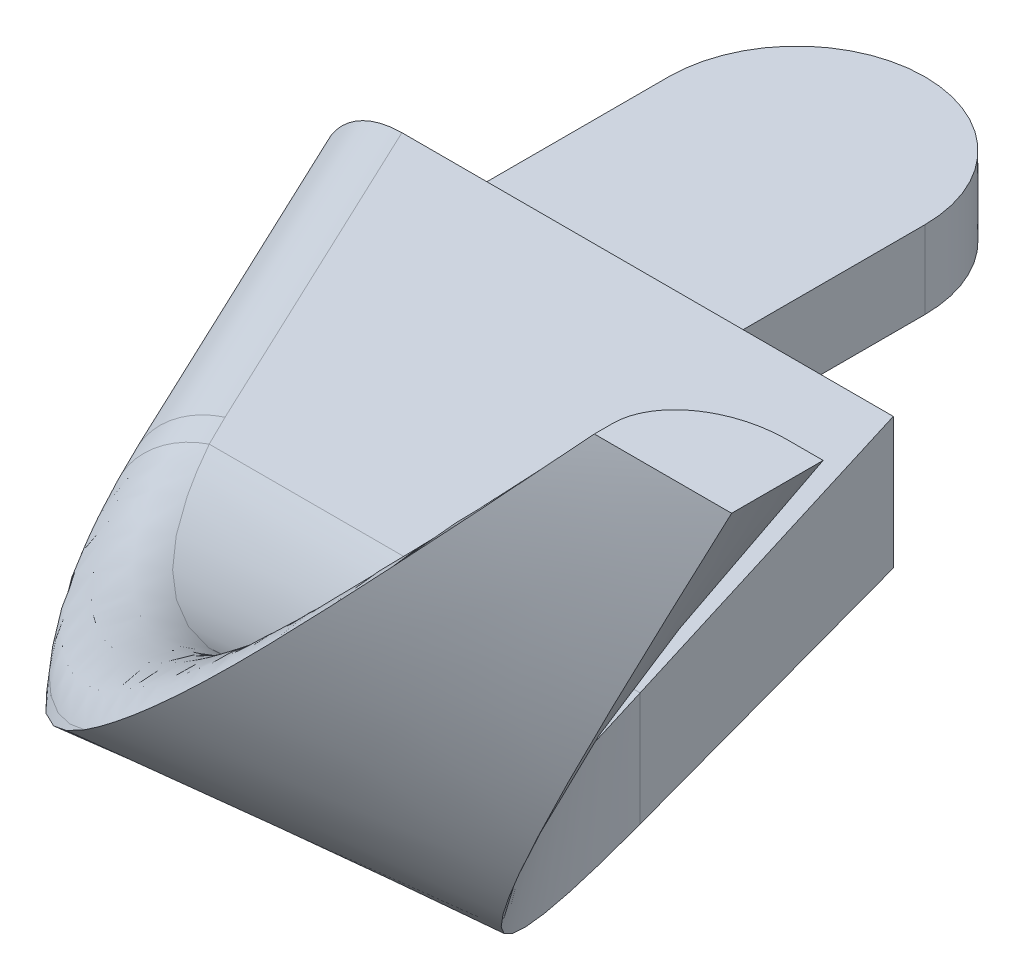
ISO-10303-21;
HEADER;
FILE_DESCRIPTION(('STEP AP214'),'2;1');
FILE_NAME('part.step','',(''),(''),'','','');
FILE_SCHEMA(('AUTOMOTIVE_DESIGN { 1 0 10303 214 1 1 1 1 }'));
ENDSEC;
DATA;
#1=APPLICATION_CONTEXT('core data for automotive mechanical design processes');
#2=APPLICATION_PROTOCOL_DEFINITION('international standard','automotive_design',2000,#1);
#3=PRODUCT_CONTEXT('',#1,'mechanical');
#4=PRODUCT('Part','Part','',(#3));
#5=PRODUCT_RELATED_PRODUCT_CATEGORY('part','',(#4));
#6=PRODUCT_DEFINITION_FORMATION('','',#4);
#7=PRODUCT_DEFINITION_CONTEXT('part definition',#1,'design');
#8=PRODUCT_DEFINITION('design','',#6,#7);
#9=PRODUCT_DEFINITION_SHAPE('','',#8);
#10=(LENGTH_UNIT() NAMED_UNIT(*) SI_UNIT(.MILLI.,.METRE.));
#11=(NAMED_UNIT(*) PLANE_ANGLE_UNIT() SI_UNIT($,.RADIAN.));
#12=(NAMED_UNIT(*) SI_UNIT($,.STERADIAN.) SOLID_ANGLE_UNIT());
#13=UNCERTAINTY_MEASURE_WITH_UNIT(LENGTH_MEASURE(1.E-05),#10,'distance_accuracy_value','');
#14=(GEOMETRIC_REPRESENTATION_CONTEXT(3) GLOBAL_UNCERTAINTY_ASSIGNED_CONTEXT((#13)) GLOBAL_UNIT_ASSIGNED_CONTEXT((#10,
#11,#12)) REPRESENTATION_CONTEXT('',''));
#15=CARTESIAN_POINT('',(0.,0.,0.));
#16=DIRECTION('',(0.,0.,1.));
#17=DIRECTION('',(1.,0.,0.));
#18=AXIS2_PLACEMENT_3D('',#15,#16,#17);
#19=CARTESIAN_POINT('',(59.5999999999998,4.8649008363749,107.));
#20=CARTESIAN_POINT('',(65.6518805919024,5.52141358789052,119.825544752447));
#21=CARTESIAN_POINT('',(75.2509402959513,15.8607067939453,119.662772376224));
#22=CARTESIAN_POINT('',(84.8500000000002,26.2,119.5));
#23=CARTESIAN_POINT('',(59.5999999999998,5.42075069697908,107.));
#24=CARTESIAN_POINT('',(65.5526235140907,5.95975546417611,119.615192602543));
#25=CARTESIAN_POINT('',(75.2013117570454,16.0798777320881,119.349262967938));
#26=CARTESIAN_POINT('',(84.8500000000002,26.2,119.083333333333));
#27=CARTESIAN_POINT('',(59.5999999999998,6.53245041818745,107.));
#28=CARTESIAN_POINT('',(65.3541093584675,6.83643921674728,119.194488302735));
#29=CARTESIAN_POINT('',(75.1020546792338,16.5182196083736,118.722244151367));
#30=CARTESIAN_POINT('',(84.8500000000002,26.2,118.25));
#31=CARTESIAN_POINT('',(59.5999999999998,7.64415013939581,107.));
#32=CARTESIAN_POINT('',(65.1659161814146,7.74547973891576,118.79565690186));
#33=CARTESIAN_POINT('',(75.0079580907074,16.9727398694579,118.106161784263));
#34=CARTESIAN_POINT('',(84.8500000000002,26.2,117.416666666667));
#35=CARTESIAN_POINT('',(59.5999999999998,8.2,107.));
#36=CARTESIAN_POINT('',(65.0718195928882,8.2,118.596241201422));
#37=CARTESIAN_POINT('',(74.9609097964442,17.2,117.798120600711));
#38=CARTESIAN_POINT('',(84.8500000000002,26.2,117.));
#39=B_SPLINE_SURFACE_WITH_KNOTS('',3,3,((#19,#20,#21,#22),(#23,#24,#25,#26),(#27,#28,#29,#30),
(#31,#32,#33,#34),(#35,#36,#37,#38)),.UNSPECIFIED.,.F.,.F.,.F.,(4,1,4),(4,4),(0.,0.5,1.),(0.,
1.),.UNSPECIFIED.);
#40=CARTESIAN_POINT('',(59.5999999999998,4.86490083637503,107.));
#41=CARTESIAN_POINT('',(65.6518805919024,5.52141358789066,119.825544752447));
#42=CARTESIAN_POINT('',(75.2509402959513,15.8607067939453,119.662772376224));
#43=CARTESIAN_POINT('',(84.8500000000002,26.2,119.5));
#44=B_SPLINE_CURVE_WITH_KNOTS('',3,(#40,#41,#42,#43),.UNSPECIFIED.,.F.,.F.,(4,4),(0.,1.),.UNSPECIFIED.);
#45=CARTESIAN_POINT('',(79.3250164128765,20.2909290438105,119.501120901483));
#46=VERTEX_POINT('',#45);
#47=CARTESIAN_POINT('',(84.8500000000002,26.2,119.5));
#48=VERTEX_POINT('',#47);
#49=EDGE_CURVE('E193',#46,#48,#44,.T.);
#50=DIRECTION('',(0.,0.,-1.));
#51=VECTOR('',#50,1.);
#52=CARTESIAN_POINT('',(84.8500000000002,26.2,119.5));
#53=LINE('',#52,#51);
#54=CARTESIAN_POINT('',(84.8500000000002,26.2,119.000411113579));
#55=VERTEX_POINT('',#54);
#56=EDGE_CURVE('E267',#48,#55,#53,.T.);
#57=CARTESIAN_POINT('',(56.6254826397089,6.20000000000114,100.696206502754));
#58=CARTESIAN_POINT('',(56.6254826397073,8.20000000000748,100.696206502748));
#59=CARTESIAN_POINT('',(58.4342317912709,8.2,99.84272744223));
#60=CARTESIAN_POINT('',(57.6169884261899,6.20000000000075,102.797471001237));
#61=CARTESIAN_POINT('',(57.6169884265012,8.20000000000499,102.797471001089));
#62=CARTESIAN_POINT('',(59.4257375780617,8.2,101.943991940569));
#63=CARTESIAN_POINT('',(58.6084942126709,6.20000000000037,104.89873549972));
#64=CARTESIAN_POINT('',(58.608494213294,8.2000000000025,104.898735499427));
#65=CARTESIAN_POINT('',(60.4172433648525,8.2,104.045256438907));
#66=CARTESIAN_POINT('',(59.5999999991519,6.19999999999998,106.999999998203));
#67=CARTESIAN_POINT('',(59.6000000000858,8.20000000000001,106.999999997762));
#68=CARTESIAN_POINT('',(61.4087491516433,8.2,106.146520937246));
#69=CARTESIAN_POINT('',(59.6723004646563,6.19998789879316,107.153318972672));
#70=CARTESIAN_POINT('',(59.6722666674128,8.19999999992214,107.153278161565));
#71=CARTESIAN_POINT('',(61.4763951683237,8.2,106.289959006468));
#72=CARTESIAN_POINT('',(59.7459888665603,6.20021102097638,107.306185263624));
#73=CARTESIAN_POINT('',(59.7461596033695,8.19999999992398,107.306054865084));
#74=CARTESIAN_POINT('',(61.5452508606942,8.2,106.432801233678));
#75=CARTESIAN_POINT('',(59.8961416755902,6.20112771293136,107.611012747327));
#76=CARTESIAN_POINT('',(59.8971542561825,8.20000000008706,107.610517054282));
#77=CARTESIAN_POINT('',(61.6853817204,8.2,106.717294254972));
#78=CARTESIAN_POINT('',(59.9726060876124,6.20182128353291,107.762973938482));
#79=CARTESIAN_POINT('',(59.9742375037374,8.20000000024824,107.762167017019));
#80=CARTESIAN_POINT('',(61.7566568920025,8.2,106.858945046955));
#81=CARTESIAN_POINT('',(60.0504584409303,6.2027500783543,107.914482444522));
#82=CARTESIAN_POINT('',(60.0529008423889,8.200000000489,107.91322672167));
#83=CARTESIAN_POINT('',(61.8291417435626,8.2,106.999999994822));
#84=CARTESIAN_POINT('',(60.1835763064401,6.20434824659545,108.173414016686));
#85=CARTESIAN_POINT('',(60.1791585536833,8.20960077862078,108.155282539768));
#86=CARTESIAN_POINT('',(61.953091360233,8.19998977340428,107.220089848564));
#87=CARTESIAN_POINT('',(60.3209004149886,6.21050615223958,108.430887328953));
#88=CARTESIAN_POINT('',(60.3092076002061,8.22354995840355,108.394589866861));
#89=CARTESIAN_POINT('',(62.0804846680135,8.20346849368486,107.43751731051));
#90=CARTESIAN_POINT('',(60.6040879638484,6.23248002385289,108.941941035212));
#91=CARTESIAN_POINT('',(60.5773902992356,8.26053964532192,108.867681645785));
#92=CARTESIAN_POINT('',(62.342269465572,8.21760449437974,107.86633371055));
#93=CARTESIAN_POINT('',(60.7499512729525,6.24829584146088,109.195521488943));
#94=CARTESIAN_POINT('',(60.7155619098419,8.28361769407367,109.101452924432));
#95=CARTESIAN_POINT('',(62.4766608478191,8.22826166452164,108.077722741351));
#96=CARTESIAN_POINT('',(61.0505811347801,6.29015658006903,109.698210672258));
#97=CARTESIAN_POINT('',(61.0003018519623,8.33935007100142,109.562821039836));
#98=CARTESIAN_POINT('',(62.7527703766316,8.25697747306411,108.494078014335));
#99=CARTESIAN_POINT('',(61.2053611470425,6.31621733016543,109.947311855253));
#100=CARTESIAN_POINT('',(61.1469240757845,8.37206022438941,109.790392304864));
#101=CARTESIAN_POINT('',(62.8944995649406,8.27504756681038,108.699033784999));
#102=CARTESIAN_POINT('',(61.523545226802,6.37898372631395,110.439552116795));
#103=CARTESIAN_POINT('',(61.448253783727,8.44734457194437,110.237890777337));
#104=CARTESIAN_POINT('',(63.1850940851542,8.31869844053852,109.101508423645));
#105=CARTESIAN_POINT('',(61.6869511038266,6.41569161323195,110.682689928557));
#106=CARTESIAN_POINT('',(61.6030083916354,8.48996545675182,110.457800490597));
#107=CARTESIAN_POINT('',(63.3339609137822,8.34428080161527,109.299025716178));
#108=CARTESIAN_POINT('',(62.1641805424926,6.53584115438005,111.364817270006));
#109=CARTESIAN_POINT('',(62.0556170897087,8.62591783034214,111.072542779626));
#110=CARTESIAN_POINT('',(63.767870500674,8.42789452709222,109.849883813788));
#111=CARTESIAN_POINT('',(62.4881689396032,6.63253050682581,111.795246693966));
#112=CARTESIAN_POINT('',(62.3623515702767,8.73139923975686,111.455583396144));
#113=CARTESIAN_POINT('',(64.0614466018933,8.49505631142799,110.193492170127));
#114=CARTESIAN_POINT('',(63.1611710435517,6.86378879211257,112.624514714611));
#115=CARTESIAN_POINT('',(62.9985930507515,8.97613385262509,112.184879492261));
#116=CARTESIAN_POINT('',(64.6708161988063,8.65474142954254,110.849930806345));
#117=CARTESIAN_POINT('',(63.510193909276,6.99837164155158,113.023341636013));
#118=CARTESIAN_POINT('',(63.3284240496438,9.11573455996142,112.530945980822));
#119=CARTESIAN_POINT('',(64.9866178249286,8.7472740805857,111.16274972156));
#120=CARTESIAN_POINT('',(64.2273580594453,7.30382025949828,113.78387661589));
#121=CARTESIAN_POINT('',(64.0050016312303,9.42606364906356,113.181615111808));
#122=CARTESIAN_POINT('',(65.6371684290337,8.95658749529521,111.756431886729));
#123=CARTESIAN_POINT('',(64.5955067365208,7.47470013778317,114.145570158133));
#124=CARTESIAN_POINT('',(64.3520139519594,9.59713381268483,113.4859300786));
#125=CARTESIAN_POINT('',(65.9719247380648,9.07337768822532,112.037282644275));
#126=CARTESIAN_POINT('',(65.3437707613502,7.84974342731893,114.828801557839));
#127=CARTESIAN_POINT('',(65.0561614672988,9.96619570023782,114.051294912));
#128=CARTESIAN_POINT('',(66.6559356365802,9.32993645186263,112.567633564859));
#129=CARTESIAN_POINT('',(65.7238824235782,8.0538966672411,115.150351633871));
#130=CARTESIAN_POINT('',(65.4134143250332,10.1644442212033,114.311975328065));
#131=CARTESIAN_POINT('',(67.0051857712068,9.46969800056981,112.817143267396));
#132=CARTESIAN_POINT('',(66.3053546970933,8.38670545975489,115.608192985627));
#133=CARTESIAN_POINT('',(65.9582367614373,10.4818515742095,114.675437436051));
#134=CARTESIAN_POINT('',(67.5431941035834,9.69875757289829,113.17402633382));
#135=CARTESIAN_POINT('',(66.5047569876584,8.50444581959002,115.759203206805));
#136=CARTESIAN_POINT('',(66.1453803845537,10.5935793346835,114.794178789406));
#137=CARTESIAN_POINT('',(67.7283511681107,9.77999562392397,113.292043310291));
#138=CARTESIAN_POINT('',(66.9042671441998,8.74754432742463,116.050589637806));
#139=CARTESIAN_POINT('',(66.5202944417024,10.8224909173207,115.02084372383));
#140=CARTESIAN_POINT('',(68.1007417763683,9.94836301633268,113.520636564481));
#141=CARTESIAN_POINT('',(67.1043748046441,8.87290040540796,116.190968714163));
#142=CARTESIAN_POINT('',(66.7080323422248,10.9396772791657,115.128698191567));
#143=CARTESIAN_POINT('',(68.2879747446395,10.0354907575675,113.631214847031));
#144=CARTESIAN_POINT('',(67.5040687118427,9.13045332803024,116.46096821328));
#145=CARTESIAN_POINT('',(67.0831251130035,11.1786046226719,115.33383849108));
#146=CARTESIAN_POINT('',(68.6634382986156,10.2153520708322,113.845029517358));
#147=CARTESIAN_POINT('',(67.7036547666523,9.26262903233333,116.590618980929));
#148=CARTESIAN_POINT('',(67.2704300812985,11.3003211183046,115.431081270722));
#149=CARTESIAN_POINT('',(68.8516643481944,10.3080684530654,113.948286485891));
#150=CARTESIAN_POINT('',(68.1023996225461,9.53378868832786,116.839939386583));
#151=CARTESIAN_POINT('',(67.644979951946,11.5481958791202,115.615995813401));
#152=CARTESIAN_POINT('',(69.2292022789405,10.4993423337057,114.148197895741));
#153=CARTESIAN_POINT('',(68.3015583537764,9.67277367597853,116.959607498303));
#154=CARTESIAN_POINT('',(67.8321539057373,11.6743265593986,115.703591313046));
#155=CARTESIAN_POINT('',(69.4185143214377,10.5979007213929,114.244851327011));
#156=CARTESIAN_POINT('',(68.5002266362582,9.81495881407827,117.074424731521));
#157=CARTESIAN_POINT('',(68.0187475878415,11.8021532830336,115.786544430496));
#158=CARTESIAN_POINT('',(69.6081134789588,10.69936872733,114.338379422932));
#159=CARTESIAN_POINT('',(68.6829092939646,9.94568742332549,117.179988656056));
#160=CARTESIAN_POINT('',(68.1909814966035,11.920144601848,115.863091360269));
#161=CARTESIAN_POINT('',(69.7824475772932,10.7926597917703,114.42435833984));
#162=CARTESIAN_POINT('',(68.8651632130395,10.0791147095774,117.281440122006));
#163=CARTESIAN_POINT('',(68.3626674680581,12.0395234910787,115.935650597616));
#164=CARTESIAN_POINT('',(69.9570070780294,10.8884002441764,114.507685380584));
#165=CARTESIAN_POINT('',(69.2286242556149,10.3510971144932,117.47638053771));
#166=CARTESIAN_POINT('',(68.7057515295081,12.281353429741,116.073692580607));
#167=CARTESIAN_POINT('',(70.3063475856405,11.0847826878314,114.669263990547));
#168=CARTESIAN_POINT('',(69.4098313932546,10.489652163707,117.569869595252));
#169=CARTESIAN_POINT('',(68.8770664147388,12.4037557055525,116.13912086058));
#170=CARTESIAN_POINT('',(70.4811285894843,11.185424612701,114.747515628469));
#171=CARTESIAN_POINT('',(69.9513070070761,10.9123766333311,117.838642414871));
#172=CARTESIAN_POINT('',(69.3909614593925,12.7754690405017,116.325725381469));
#173=CARTESIAN_POINT('',(71.0051775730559,11.4945399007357,114.974877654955));
#174=CARTESIAN_POINT('',(70.3097328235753,11.2038227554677,118.002405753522));
#175=CARTESIAN_POINT('',(69.7319196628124,13.0281826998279,116.436579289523));
#176=CARTESIAN_POINT('',(71.3544409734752,11.7103572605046,115.116736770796));
#177=CARTESIAN_POINT('',(70.7645296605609,11.5874656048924,118.193497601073));
#178=CARTESIAN_POINT('',(70.1676336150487,13.3577102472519,116.564127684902));
#179=CARTESIAN_POINT('',(71.8003180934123,11.9986339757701,115.286656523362));
#180=CARTESIAN_POINT('',(70.8637857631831,11.6720480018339,118.234169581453));
#181=CARTESIAN_POINT('',(70.2629918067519,13.4302346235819,116.591172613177));
#182=CARTESIAN_POINT('',(71.8977948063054,12.0624403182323,115.323117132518));
#183=CARTESIAN_POINT('',(71.0618041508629,11.8424465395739,118.313288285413));
#184=CARTESIAN_POINT('',(70.4536455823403,13.5760145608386,116.643572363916));
#185=CARTESIAN_POINT('',(72.0925838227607,12.191498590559,115.394629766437));
#186=CARTESIAN_POINT('',(71.1605665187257,11.9282624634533,118.351735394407));
#187=CARTESIAN_POINT('',(70.5489221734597,13.6492559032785,116.668921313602));
#188=CARTESIAN_POINT('',(72.1898961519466,12.2567502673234,115.429682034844));
#189=CARTESIAN_POINT('',(71.7227337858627,12.4213475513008,118.564914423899));
#190=CARTESIAN_POINT('',(71.0928798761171,14.0695171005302,116.809104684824));
#191=CARTESIAN_POINT('',(72.7446902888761,12.6332040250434,115.625763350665));
#192=CARTESIAN_POINT('',(72.1811042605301,12.8413283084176,118.716687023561));
#193=CARTESIAN_POINT('',(71.5398001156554,14.4229926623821,116.906652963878));
#194=CARTESIAN_POINT('',(73.2004752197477,12.9597329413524,115.772255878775));
#195=CARTESIAN_POINT('',(73.087685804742,13.7013717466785,118.976858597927));
#196=CARTESIAN_POINT('',(72.4365586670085,15.1457326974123,117.073393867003));
#197=CARTESIAN_POINT('',(74.107374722,13.641299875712,116.036683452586));
#198=CARTESIAN_POINT('',(73.5358896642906,14.1414480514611,119.085227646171));
#199=CARTESIAN_POINT('',(72.88442324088,15.5133786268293,117.142279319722));
#200=CARTESIAN_POINT('',(74.5584858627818,13.996357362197,116.154598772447));
#201=CARTESIAN_POINT('',(74.4252867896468,15.0368485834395,119.264069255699));
#202=CARTESIAN_POINT('',(73.7853141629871,16.2642856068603,117.256601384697));
#203=CARTESIAN_POINT('',(75.4577899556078,14.7313665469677,116.364225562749));
#204=CARTESIAN_POINT('',(74.8664498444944,15.492221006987,119.334407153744));
#205=CARTESIAN_POINT('',(74.2366743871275,16.6461209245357,117.301905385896));
#206=CARTESIAN_POINT('',(75.9059670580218,15.111401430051,116.455843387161));
#207=CARTESIAN_POINT('',(75.7423572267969,16.411150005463,119.442237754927));
#208=CARTESIAN_POINT('',(75.1427633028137,17.4222094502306,117.372397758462));
#209=CARTESIAN_POINT('',(76.7988098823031,15.8899729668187,116.614896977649));
#210=CARTESIAN_POINT('',(76.1771028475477,16.8747048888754,119.479737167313));
#211=CARTESIAN_POINT('',(75.5962345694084,17.8152901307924,117.397692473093));
#212=CARTESIAN_POINT('',(77.2434763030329,16.2885058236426,116.682337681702));
#213=CARTESIAN_POINT('',(77.0665259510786,17.8314280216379,119.528983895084));
#214=CARTESIAN_POINT('',(76.5308466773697,18.6334424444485,117.432260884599));
#215=CARTESIAN_POINT('',(78.1553369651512,17.1217148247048,116.799284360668));
#216=CARTESIAN_POINT('',(77.5209821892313,18.3248209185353,119.539198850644));
#217=CARTESIAN_POINT('',(77.011560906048,19.0584754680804,117.440784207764));
#218=CARTESIAN_POINT('',(78.6224228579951,17.5571726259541,116.847597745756));
#219=CARTESIAN_POINT('',(78.1998686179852,19.0639816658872,119.536853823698));
#220=CARTESIAN_POINT('',(77.7354455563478,19.7035588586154,117.442031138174));
#221=CARTESIAN_POINT('',(79.3213468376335,18.2170422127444,116.90535611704));
#222=CARTESIAN_POINT('',(78.425026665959,19.3094789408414,119.533164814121));
#223=CARTESIAN_POINT('',(77.9751780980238,19.9180055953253,117.440581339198));
#224=CARTESIAN_POINT('',(79.5533441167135,18.437441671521,116.922128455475));
#225=CARTESIAN_POINT('',(78.8751214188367,19.8003598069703,119.520737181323));
#226=CARTESIAN_POINT('',(78.4550770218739,20.3487143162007,117.434327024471));
#227=CARTESIAN_POINT('',(80.0174441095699,18.8804285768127,116.951378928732));
#228=CARTESIAN_POINT('',(79.100058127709,20.0457434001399,119.511998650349));
#229=CARTESIAN_POINT('',(78.6952254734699,20.5649505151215,117.429545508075));
#230=CARTESIAN_POINT('',(80.2495468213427,19.1030159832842,116.963857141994));
#231=CARTESIAN_POINT('',(79.3250164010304,20.2909290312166,119.501120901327));
#232=CARTESIAN_POINT('',(78.9364403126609,20.7827571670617,117.423267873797));
#233=CARTESIAN_POINT('',(80.4818114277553,19.3264790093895,116.974445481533));
#234=CARTESIAN_POINT('',(79.5535201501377,20.5400059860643,119.490064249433));
#235=CARTESIAN_POINT('',(79.179765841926,21.0024734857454,117.416935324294));
#236=CARTESIAN_POINT('',(80.7177460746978,19.5534866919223,116.985201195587));
#237=CARTESIAN_POINT('',(79.7820401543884,20.7888702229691,119.476807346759));
#238=CARTESIAN_POINT('',(79.4241850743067,21.223802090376,117.409087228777));
#239=CARTESIAN_POINT('',(80.9538346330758,19.7813961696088,116.994007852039));
#240=CARTESIAN_POINT('',(80.239286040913,21.2860084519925,119.44663953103));
#241=CARTESIAN_POINT('',(79.9134063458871,21.6678729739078,117.390814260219));
#242=CARTESIAN_POINT('',(81.4264936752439,20.2386853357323,117.008273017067));
#243=CARTESIAN_POINT('',(80.4680119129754,21.5342824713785,119.429728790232));
#244=CARTESIAN_POINT('',(80.1582418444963,21.8906384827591,117.380405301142));
#245=CARTESIAN_POINT('',(81.6630641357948,20.468064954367,117.013731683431));
#246=CARTESIAN_POINT('',(81.1547305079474,22.2779420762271,119.374638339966));
#247=CARTESIAN_POINT('',(80.8909908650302,22.5586456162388,117.346063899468));
#248=CARTESIAN_POINT('',(82.373730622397,21.1578808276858,117.025910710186));
#249=CARTESIAN_POINT('',(81.6133241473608,22.7722307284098,119.332097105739));
#250=CARTESIAN_POINT('',(81.3822573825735,23.0082232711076,117.318859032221));
#251=CARTESIAN_POINT('',(82.8488436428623,21.620053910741,117.028436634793));
#252=CARTESIAN_POINT('',(82.5330447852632,23.7572833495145,119.241071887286));
#253=CARTESIAN_POINT('',(82.3663113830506,23.9110157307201,117.259335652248));
#254=CARTESIAN_POINT('',(83.8030690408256,22.5471077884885,117.026822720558));
#255=CARTESIAN_POINT('',(82.9941713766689,24.2480478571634,119.192588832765));
#256=CARTESIAN_POINT('',(82.8598469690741,24.3648912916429,117.227029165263));
#257=CARTESIAN_POINT('',(84.2821807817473,23.0119881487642,117.022683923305));
#258=CARTESIAN_POINT('',(83.6882636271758,24.9817476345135,119.119605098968));
#259=CARTESIAN_POINT('',(83.6033494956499,25.0496295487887,117.177411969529));
#260=CARTESIAN_POINT('',(85.0050086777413,23.7106170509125,117.015149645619));
#261=CARTESIAN_POINT('',(83.9200446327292,25.225923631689,119.095232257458));
#262=CARTESIAN_POINT('',(83.8510590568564,25.2779216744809,117.160726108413));
#263=CARTESIAN_POINT('',(85.2466619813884,23.9437279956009,117.012416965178));
#264=CARTESIAN_POINT('',(84.3844129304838,25.7135149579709,119.047143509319));
#265=CARTESIAN_POINT('',(84.3471443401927,25.7353700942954,117.127514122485));
#266=CARTESIAN_POINT('',(85.7315562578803,24.4103128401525,117.00721388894));
#267=CARTESIAN_POINT('',(84.617000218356,25.9569302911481,119.02342759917));
#268=CARTESIAN_POINT('',(84.5956686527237,25.964662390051,117.110977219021));
#269=CARTESIAN_POINT('',(85.9747972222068,24.6437867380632,117.004743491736));
#270=CARTESIAN_POINT('',(84.8499999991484,26.1999999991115,119.000411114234));
#271=CARTESIAN_POINT('',(84.8450414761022,26.1948270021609,117.094738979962));
#272=CARTESIAN_POINT('',(86.2189392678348,24.8774122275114,117.002756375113));
#273=CARTESIAN_POINT('',(84.9597406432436,26.3144884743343,118.989574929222));
#274=CARTESIAN_POINT('',(84.962195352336,26.3029596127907,117.08711445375));
#275=CARTESIAN_POINT('',(86.3339338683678,24.9874540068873,117.001827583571));
#276=CARTESIAN_POINT('',(85.0695550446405,26.4288832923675,118.978897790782));
#277=CARTESIAN_POINT('',(85.0795450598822,26.4112924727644,117.079557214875));
#278=CARTESIAN_POINT('',(86.4491304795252,25.097531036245,117.001009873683));
#279=CARTESIAN_POINT('',(85.2893086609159,26.6575002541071,118.957954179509));
#280=CARTESIAN_POINT('',(85.3144050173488,26.6281652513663,117.064653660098));
#281=CARTESIAN_POINT('',(86.6799493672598,25.3177665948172,116.999690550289));
#282=CARTESIAN_POINT('',(85.3992478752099,26.7717223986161,118.947687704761));
#283=CARTESIAN_POINT('',(85.4319348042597,26.7367231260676,117.057305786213));
#284=CARTESIAN_POINT('',(86.7955716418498,25.4279251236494,116.99918893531));
#285=CARTESIAN_POINT('',(85.6192296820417,27.0000099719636,118.927657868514));
#286=CARTESIAN_POINT('',(85.6671586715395,26.9540690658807,117.042881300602));
#287=CARTESIAN_POINT('',(87.0272648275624,25.6483359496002,116.998595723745));
#288=CARTESIAN_POINT('',(85.7292722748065,27.1140754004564,118.917894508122));
#289=CARTESIAN_POINT('',(85.7848739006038,27.0628765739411,117.035803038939));
#290=CARTESIAN_POINT('',(87.1433357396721,25.7585882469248,116.998504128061));
#291=CARTESIAN_POINT('',(85.9494328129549,27.3420697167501,118.898972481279));
#292=CARTESIAN_POINT('',(86.0204683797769,27.2807498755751,117.021982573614));
#293=CARTESIAN_POINT('',(87.3759538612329,25.979205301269,116.998837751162));
#294=CARTESIAN_POINT('',(86.0595507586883,27.4559986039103,118.889813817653));
#295=CARTESIAN_POINT('',(86.1383708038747,27.3898369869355,117.015238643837));
#296=CARTESIAN_POINT('',(87.4925010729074,26.0895700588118,116.999262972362));
#297=CARTESIAN_POINT('',(86.1696919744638,27.5698689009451,118.881008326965));
#298=CARTESIAN_POINT('',(86.2564114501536,27.499119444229,117.008692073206));
#299=CARTESIAN_POINT('',(87.609299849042,26.199999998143,116.999999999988));
#300=CARTESIAN_POINT('',(86.2919171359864,27.6962355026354,118.871241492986));
#301=CARTESIAN_POINT('',(86.3872820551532,27.6202822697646,117.001436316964));
#302=CARTESIAN_POINT('',(87.7389187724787,26.3225505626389,117.000824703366));
#303=CARTESIAN_POINT('',(86.4141712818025,27.8225301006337,118.861906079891));
#304=CARTESIAN_POINT('',(86.5183032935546,27.7416543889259,116.994343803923));
#305=CARTESIAN_POINT('',(87.8688363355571,26.4450561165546,117.00202785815));
#306=CARTESIAN_POINT('',(86.6586795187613,28.0750042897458,118.844225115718));
#307=CARTESIAN_POINT('',(86.7804422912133,27.9846728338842,116.980559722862));
#308=CARTESIAN_POINT('',(88.1293302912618,26.6900244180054,117.00534405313));
#309=CARTESIAN_POINT('',(86.7809336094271,28.2011838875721,118.835879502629));
#310=CARTESIAN_POINT('',(86.9116084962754,28.1063639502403,116.973865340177));
#311=CARTESIAN_POINT('',(88.2599066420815,26.8124871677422,117.00745703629));
#312=CARTESIAN_POINT('',(87.0458072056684,28.474534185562,118.81900363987));
#313=CARTESIAN_POINT('',(87.1959950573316,28.3704562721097,116.959859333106));
#314=CARTESIAN_POINT('',(88.5436586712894,27.0778806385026,117.01318745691));
#315=CARTESIAN_POINT('',(87.1884189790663,28.6216921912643,118.810675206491));
#316=CARTESIAN_POINT('',(87.3493249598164,28.5130007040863,116.952627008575));
#317=CARTESIAN_POINT('',(88.6969676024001,27.2208149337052,117.016997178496));
#318=CARTESIAN_POINT('',(87.4734828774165,28.9159781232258,118.795796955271));
#319=CARTESIAN_POINT('',(87.6562566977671,28.7987490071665,116.93892183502));
#320=CARTESIAN_POINT('',(89.0047437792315,27.5068333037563,117.026388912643));
#321=CARTESIAN_POINT('',(87.6159350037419,29.0631060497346,118.789247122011));
#322=CARTESIAN_POINT('',(87.8099534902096,28.9420414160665,116.932445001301));
#323=CARTESIAN_POINT('',(89.1592110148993,27.6499173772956,117.031970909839));
#324=CARTESIAN_POINT('',(87.900581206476,29.3574290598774,118.778243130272));
#325=CARTESIAN_POINT('',(88.1177725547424,29.2295456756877,116.920413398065));
#326=CARTESIAN_POINT('',(89.4695316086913,27.936420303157,117.045315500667));
#327=CARTESIAN_POINT('',(88.042775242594,29.5046241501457,118.773789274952));
#328=CARTESIAN_POINT('',(88.2720039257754,29.3738600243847,116.914855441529));
#329=CARTESIAN_POINT('',(89.6253851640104,28.0798392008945,117.053078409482));
#330=CARTESIAN_POINT('',(88.3267194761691,29.7991549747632,118.767435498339));
#331=CARTESIAN_POINT('',(88.5810622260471,29.6637434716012,116.904919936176));
#332=CARTESIAN_POINT('',(89.9387745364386,28.3672693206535,117.071396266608));
#333=CARTESIAN_POINT('',(88.4684696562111,29.9464907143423,118.765535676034));
#334=CARTESIAN_POINT('',(88.7360186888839,29.809435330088,116.900540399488));
#335=CARTESIAN_POINT('',(90.0963104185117,28.5112805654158,117.081951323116));
#336=CARTESIAN_POINT('',(88.6099098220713,30.0939384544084,118.765141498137));
#337=CARTESIAN_POINT('',(88.8912161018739,29.9557912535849,116.89688827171));
#338=CARTESIAN_POINT('',(90.2548405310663,28.6557215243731,117.094208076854));
#339=CARTESIAN_POINT('',(88.6833319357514,30.1704870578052,118.764953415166));
#340=CARTESIAN_POINT('',(88.9719490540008,30.0319325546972,116.895001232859));
#341=CARTESIAN_POINT('',(90.3371529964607,28.7307226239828,117.100596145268));
#342=CARTESIAN_POINT('',(88.7566672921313,30.2470667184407,118.765180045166));
#343=CARTESIAN_POINT('',(89.0527698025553,30.1082811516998,116.893331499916));
#344=CARTESIAN_POINT('',(90.419724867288,28.8058543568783,117.107454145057));
#345=CARTESIAN_POINT('',(88.9031144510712,30.4002972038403,118.76657541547));
#346=CARTESIAN_POINT('',(89.2147033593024,30.261557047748,116.890517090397));
#347=CARTESIAN_POINT('',(90.585442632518,28.9564633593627,117.122266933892));
#348=CARTESIAN_POINT('',(88.9762262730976,30.4769480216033,118.767744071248));
#349=CARTESIAN_POINT('',(89.2958383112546,30.3385057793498,116.88937285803));
#350=CARTESIAN_POINT('',(90.6685884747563,29.0319405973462,117.130221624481));
#351=CARTESIAN_POINT('',(89.1221911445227,30.6303453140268,118.771136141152));
#352=CARTESIAN_POINT('',(89.4584723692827,30.4931061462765,116.887704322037));
#353=CARTESIAN_POINT('',(90.8355260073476,29.1833399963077,117.147386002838));
#354=CARTESIAN_POINT('',(89.1950441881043,30.707091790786,118.773359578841));
#355=CARTESIAN_POINT('',(89.5399956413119,30.5707814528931,116.887180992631));
#356=CARTESIAN_POINT('',(90.9193177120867,29.2592621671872,117.156595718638));
#357=CARTESIAN_POINT('',(89.3404382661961,30.8607025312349,118.779008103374));
#358=CARTESIAN_POINT('',(89.703494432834,30.7269974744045,116.88688849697));
#359=CARTESIAN_POINT('',(91.0876356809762,29.411686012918,117.176482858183));
#360=CARTESIAN_POINT('',(89.4129792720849,30.9375668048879,118.782433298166));
#361=CARTESIAN_POINT('',(89.7854966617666,30.8055647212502,116.887121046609));
#362=CARTESIAN_POINT('',(91.1721620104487,29.4881877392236,117.187160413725));
#363=CARTESIAN_POINT('',(89.4853319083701,31.0144950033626,118.786532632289));
#364=CARTESIAN_POINT('',(89.8676639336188,30.8845460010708,116.88779887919));
#365=CARTESIAN_POINT('',(91.2570934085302,29.5650405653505,117.198677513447));
#366=(BOUNDED_SURFACE() B_SPLINE_SURFACE(3,2,((#57,#58,#59),(#60,#61,#62),(#63,#64,#65),(#66,
#67,#68),(#69,#70,#71),(#72,#73,#74),(#75,#76,#77),(#78,#79,#80),(#81,#82,#83),(#84,#85,#86),
(#87,#88,#89),(#90,#91,#92),(#93,#94,#95),(#96,#97,#98),(#99,#100,#101),(#102,#103,#104),(#105,
#106,#107),(#108,#109,#110),(#111,#112,#113),(#114,#115,#116),(#117,#118,#119),(#120,#121,#122),
(#123,#124,#125),(#126,#127,#128),(#129,#130,#131),(#132,#133,#134),(#135,#136,#137),(#138,#139,
#140),(#141,#142,#143),(#144,#145,#146),(#147,#148,#149),(#150,#151,#152),(#153,#154,#155),
(#156,#157,#158),(#159,#160,#161),(#162,#163,#164),(#165,#166,#167),(#168,#169,#170),(#171,#172,
#173),(#174,#175,#176),(#177,#178,#179),(#180,#181,#182),(#183,#184,#185),(#186,#187,#188),
(#189,#190,#191),(#192,#193,#194),(#195,#196,#197),(#198,#199,#200),(#201,#202,#203),(#204,#205,
#206),(#207,#208,#209),(#210,#211,#212),(#213,#214,#215),(#216,#217,#218),(#219,#220,#221),
(#222,#223,#224),(#225,#226,#227),(#228,#229,#230),(#231,#232,#233),(#234,#235,#236),(#237,#238,
#239),(#240,#241,#242),(#243,#244,#245),(#246,#247,#248),(#249,#250,#251),(#252,#253,#254),
(#255,#256,#257),(#258,#259,#260),(#261,#262,#263),(#264,#265,#266),(#267,#268,#269),(#270,#271,
#272),(#273,#274,#275),(#276,#277,#278),(#279,#280,#281),(#282,#283,#284),(#285,#286,#287),
(#288,#289,#290),(#291,#292,#293),(#294,#295,#296),(#297,#298,#299),(#300,#301,#302),(#303,#304,
#305),(#306,#307,#308),(#309,#310,#311),(#312,#313,#314),(#315,#316,#317),(#318,#319,#320),
(#321,#322,#323),(#324,#325,#326),(#327,#328,#329),(#330,#331,#332),(#333,#334,#335),(#336,#337,
#338),(#339,#340,#341),(#342,#343,#344),(#345,#346,#347),(#348,#349,#350),(#351,#352,#353),
(#354,#355,#356),(#357,#358,#359),(#360,#361,#362),(#363,#364,#365)),.UNSPECIFIED.,.F.,.F.,
.F.) B_SPLINE_SURFACE_WITH_KNOTS((4,3,2,3,2,2,2,2,2,2,2,2,2,2,2,3,2,2,2,2,2,2,2,2,2,2,2,3,2,2,2,
2,2,3,2,2,2,3,2,2,2,2,2,3,2,2,2,4),(3,3),(0.,6.97033470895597,7.44605003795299,7.92176620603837,
8.73503013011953,9.54828156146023,10.3627944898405,11.1774789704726,12.6822662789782,
14.1876069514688,15.6935338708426,17.1990013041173,17.9803827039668,18.7615526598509,
19.5404316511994,20.3194295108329,21.0356002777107,21.7517613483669,23.1828975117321,
23.5836920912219,23.9844170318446,25.8701786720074,27.7572383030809,29.650936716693,
31.544248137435,33.5418538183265,34.5347190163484,35.5275660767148,36.5361139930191,
37.5446143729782,39.5613501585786,41.5777707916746,42.5861241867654,43.5944721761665,
44.0694064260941,44.5443384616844,45.0192715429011,45.4942068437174,46.0212573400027,
46.5482748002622,47.1632838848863,47.7782876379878,48.3933803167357,49.0084968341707,
49.3278354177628,49.6471453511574,49.9664624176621,50.2858081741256),(0.,1.),
.UNSPECIFIED.) GEOMETRIC_REPRESENTATION_ITEM() RATIONAL_B_SPLINE_SURFACE(((1.,0.707106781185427,
1.),(1.,0.707106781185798,1.),(1.,0.70710678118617,1.),(1.,0.707106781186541,1.),(1.,
0.707104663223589,1.),(1.,0.707144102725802,1.),(1.,0.707306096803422,1.),(1.,0.707428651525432,
1.),(1.,0.707592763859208,1.),(1.,0.706179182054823,1.),(1.,0.704761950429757,1.),(1.,
0.701913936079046,1.),(1.,0.700483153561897,1.),(1.,0.697599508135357,1.),(1.,0.696146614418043,
1.),(1.,0.69321433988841,1.),(1.,0.691734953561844,1.),(1.,0.687476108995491,1.),(1.,
0.684656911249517,1.),(1.,0.678886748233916,1.),(1.,0.675935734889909,1.),(1.,0.669925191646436,
1.),(1.,0.66686561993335,1.),(1.,0.660724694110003,1.),(1.,0.657643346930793,1.),(1.,
0.653061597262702,1.),(1.,0.651513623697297,1.),(1.,0.648479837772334,1.),(1.,0.646994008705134,
1.),(1.,0.644117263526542,1.),(1.,0.642726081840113,1.),(1.,0.640063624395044,1.),(1.,
0.638792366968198,1.),(1.,0.637596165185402,1.),(1.,0.636496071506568,1.),(1.,0.635462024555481,
1.),(1.,0.633545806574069,1.),(1.,0.632663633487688,1.),(1.,0.630275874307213,1.),(1.,
0.629027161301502,1.),(1.,0.627934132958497,1.),(1.,0.627725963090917,1.),(1.,0.627372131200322,
1.),(1.,0.627226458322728,1.),(1.,0.626578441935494,1.),(1.,0.626754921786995,1.),(1.,
0.628490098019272,1.),(1.,0.630049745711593,1.),(1.,0.634345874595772,1.),(1.,0.637086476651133,
1.),(1.,0.643439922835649,1.),(1.,0.647052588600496,1.),(1.,0.655036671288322,1.),(1.,
0.659438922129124,1.),(1.,0.666211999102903,1.),(1.,0.668490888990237,1.),(1.,0.673069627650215,
1.),(1.,0.675369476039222,1.),(1.,0.677660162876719,1.),(1.,0.679987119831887,1.),(1.,
0.682304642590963,1.),(1.,0.686888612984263,1.),(1.,0.689155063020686,1.),(1.,0.695829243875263,
1.),(1.,0.700112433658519,1.),(1.,0.708123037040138,1.),(1.,0.71185053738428,1.),(1.,
0.716869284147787,1.),(1.,0.718446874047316,1.),(1.,0.721381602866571,1.),(1.,0.722738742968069,
1.),(1.,0.723970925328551,1.),(1.,0.724550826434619,1.),(1.,0.725102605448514,1.),(1.,
0.726144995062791,1.),(1.,0.726635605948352,1.),(1.,0.727550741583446,1.),(1.,0.727975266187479,
1.),(1.,0.728752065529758,1.),(1.,0.729104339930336,1.),(1.,0.729417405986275,1.),(1.,
0.729764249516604,1.),(1.,0.730049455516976,1.),(1.,0.730484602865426,1.),(1.,0.7306345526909,
1.),(1.,0.730799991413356,1.),(1.,0.730788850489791,1.),(1.,0.730540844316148,1.),(1.,
0.730303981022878,1.),(1.,0.72957291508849,1.),(1.,0.729078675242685,1.),(1.,0.72778798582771,
1.),(1.,0.726991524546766,1.),(1.,0.72602154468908,1.),(1.,0.72551665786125,1.),(1.,
0.724967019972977,1.),(1.,0.723771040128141,1.),(1.,0.723124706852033,1.),(1.,0.721728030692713,
1.),(1.,0.720977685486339,1.),(1.,0.719364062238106,1.),(1.,0.71850077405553,1.),(1.,
0.717576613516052,1.))) REPRESENTATION_ITEM('') SURFACE());
#367=CARTESIAN_POINT('',(56.6254826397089,6.20000000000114,100.696206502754));
#368=CARTESIAN_POINT('',(57.6169884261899,6.20000000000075,102.797471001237));
#369=CARTESIAN_POINT('',(58.6084942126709,6.20000000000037,104.89873549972));
#370=CARTESIAN_POINT('',(59.5999999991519,6.19999999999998,106.999999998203));
#371=CARTESIAN_POINT('',(59.6723004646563,6.19998789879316,107.153318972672));
#372=CARTESIAN_POINT('',(59.7459888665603,6.20021102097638,107.306185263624));
#373=CARTESIAN_POINT('',(59.8961416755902,6.20112771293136,107.611012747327));
#374=CARTESIAN_POINT('',(59.9726060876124,6.20182128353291,107.762973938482));
#375=CARTESIAN_POINT('',(60.0504584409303,6.2027500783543,107.914482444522));
#376=CARTESIAN_POINT('',(60.1835763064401,6.20434824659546,108.173414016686));
#377=CARTESIAN_POINT('',(60.3209004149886,6.21050615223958,108.430887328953));
#378=CARTESIAN_POINT('',(60.6040879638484,6.23248002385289,108.941941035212));
#379=CARTESIAN_POINT('',(60.7499512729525,6.24829584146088,109.195521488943));
#380=CARTESIAN_POINT('',(61.0505811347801,6.29015658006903,109.698210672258));
#381=CARTESIAN_POINT('',(61.2053611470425,6.31621733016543,109.947311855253));
#382=CARTESIAN_POINT('',(61.523545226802,6.37898372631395,110.439552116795));
#383=CARTESIAN_POINT('',(61.6869511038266,6.41569161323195,110.682689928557));
#384=CARTESIAN_POINT('',(62.1641805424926,6.53584115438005,111.364817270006));
#385=CARTESIAN_POINT('',(62.4881689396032,6.63253050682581,111.795246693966));
#386=CARTESIAN_POINT('',(63.1611710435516,6.86378879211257,112.624514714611));
#387=CARTESIAN_POINT('',(63.510193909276,6.99837164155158,113.023341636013));
#388=CARTESIAN_POINT('',(64.2273580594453,7.30382025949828,113.78387661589));
#389=CARTESIAN_POINT('',(64.5955067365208,7.47470013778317,114.145570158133));
#390=CARTESIAN_POINT('',(65.3437707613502,7.84974342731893,114.828801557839));
#391=CARTESIAN_POINT('',(65.7238824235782,8.0538966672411,115.150351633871));
#392=CARTESIAN_POINT('',(66.3053546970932,8.38670545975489,115.608192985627));
#393=CARTESIAN_POINT('',(66.5047569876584,8.50444581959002,115.759203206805));
#394=CARTESIAN_POINT('',(66.9042671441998,8.74754432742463,116.050589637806));
#395=CARTESIAN_POINT('',(67.1043748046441,8.87290040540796,116.190968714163));
#396=CARTESIAN_POINT('',(67.5040687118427,9.13045332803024,116.46096821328));
#397=CARTESIAN_POINT('',(67.7036547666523,9.26262903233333,116.590618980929));
#398=CARTESIAN_POINT('',(68.1023996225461,9.53378868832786,116.839939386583));
#399=CARTESIAN_POINT('',(68.3015583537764,9.67277367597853,116.959607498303));
#400=CARTESIAN_POINT('',(68.5002266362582,9.81495881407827,117.074424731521));
#401=CARTESIAN_POINT('',(68.6829092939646,9.94568742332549,117.179988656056));
#402=CARTESIAN_POINT('',(68.8651632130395,10.0791147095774,117.281440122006));
#403=CARTESIAN_POINT('',(69.2286242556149,10.3510971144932,117.47638053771));
#404=CARTESIAN_POINT('',(69.4098313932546,10.489652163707,117.569869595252));
#405=CARTESIAN_POINT('',(69.9513070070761,10.9123766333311,117.838642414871));
#406=CARTESIAN_POINT('',(70.3097328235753,11.2038227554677,118.002405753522));
#407=CARTESIAN_POINT('',(70.7645296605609,11.5874656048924,118.193497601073));
#408=CARTESIAN_POINT('',(70.8637857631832,11.6720480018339,118.234169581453));
#409=CARTESIAN_POINT('',(71.0618041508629,11.8424465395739,118.313288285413));
#410=CARTESIAN_POINT('',(71.1605665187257,11.9282624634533,118.351735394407));
#411=CARTESIAN_POINT('',(71.7227337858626,12.4213475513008,118.564914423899));
#412=CARTESIAN_POINT('',(72.1811042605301,12.8413283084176,118.716687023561));
#413=CARTESIAN_POINT('',(73.087685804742,13.7013717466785,118.976858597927));
#414=CARTESIAN_POINT('',(73.5358896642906,14.1414480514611,119.085227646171));
#415=CARTESIAN_POINT('',(74.4252867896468,15.0368485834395,119.264069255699));
#416=CARTESIAN_POINT('',(74.8664498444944,15.492221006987,119.334407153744));
#417=CARTESIAN_POINT('',(75.7423572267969,16.411150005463,119.442237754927));
#418=CARTESIAN_POINT('',(76.1771028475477,16.8747048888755,119.479737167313));
#419=CARTESIAN_POINT('',(77.0665259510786,17.8314280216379,119.528983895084));
#420=CARTESIAN_POINT('',(77.5209821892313,18.3248209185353,119.539198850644));
#421=CARTESIAN_POINT('',(78.1998686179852,19.0639816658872,119.536853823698));
#422=CARTESIAN_POINT('',(78.425026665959,19.3094789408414,119.533164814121));
#423=CARTESIAN_POINT('',(78.8751214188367,19.8003598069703,119.520737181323));
#424=CARTESIAN_POINT('',(79.100058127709,20.0457434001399,119.511998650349));
#425=CARTESIAN_POINT('',(79.3250164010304,20.2909290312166,119.501120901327));
#426=CARTESIAN_POINT('',(79.5535201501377,20.5400059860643,119.490064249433));
#427=CARTESIAN_POINT('',(79.7820401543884,20.7888702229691,119.476807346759));
#428=CARTESIAN_POINT('',(80.239286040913,21.2860084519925,119.44663953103));
#429=CARTESIAN_POINT('',(80.4680119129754,21.5342824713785,119.429728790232));
#430=CARTESIAN_POINT('',(81.1547305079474,22.2779420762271,119.374638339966));
#431=CARTESIAN_POINT('',(81.6133241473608,22.7722307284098,119.332097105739));
#432=CARTESIAN_POINT('',(82.5330447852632,23.7572833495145,119.241071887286));
#433=CARTESIAN_POINT('',(82.9941713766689,24.2480478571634,119.192588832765));
#434=CARTESIAN_POINT('',(83.6882636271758,24.9817476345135,119.119605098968));
#435=CARTESIAN_POINT('',(83.9200446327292,25.225923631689,119.095232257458));
#436=CARTESIAN_POINT('',(84.3844129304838,25.7135149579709,119.047143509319));
#437=CARTESIAN_POINT('',(84.617000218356,25.9569302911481,119.02342759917));
#438=CARTESIAN_POINT('',(84.8499999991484,26.1999999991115,119.000411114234));
#439=CARTESIAN_POINT('',(84.9597406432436,26.3144884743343,118.989574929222));
#440=CARTESIAN_POINT('',(85.0695550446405,26.4288832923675,118.978897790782));
#441=CARTESIAN_POINT('',(85.2893086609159,26.6575002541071,118.957954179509));
#442=CARTESIAN_POINT('',(85.3992478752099,26.7717223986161,118.947687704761));
#443=CARTESIAN_POINT('',(85.6192296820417,27.0000099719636,118.927657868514));
#444=CARTESIAN_POINT('',(85.7292722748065,27.1140754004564,118.917894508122));
#445=CARTESIAN_POINT('',(85.9494328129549,27.3420697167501,118.898972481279));
#446=CARTESIAN_POINT('',(86.0595507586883,27.4559986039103,118.889813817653));
#447=CARTESIAN_POINT('',(86.1696919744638,27.5698689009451,118.881008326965));
#448=CARTESIAN_POINT('',(86.2919171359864,27.6962355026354,118.871241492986));
#449=CARTESIAN_POINT('',(86.4141712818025,27.8225301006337,118.861906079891));
#450=CARTESIAN_POINT('',(86.6586795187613,28.0750042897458,118.844225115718));
#451=CARTESIAN_POINT('',(86.7809336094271,28.2011838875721,118.835879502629));
#452=CARTESIAN_POINT('',(87.0458072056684,28.474534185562,118.81900363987));
#453=CARTESIAN_POINT('',(87.1884189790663,28.6216921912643,118.810675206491));
#454=CARTESIAN_POINT('',(87.4734828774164,28.9159781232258,118.795796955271));
#455=CARTESIAN_POINT('',(87.6159350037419,29.0631060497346,118.789247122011));
#456=CARTESIAN_POINT('',(87.900581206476,29.3574290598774,118.778243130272));
#457=CARTESIAN_POINT('',(88.042775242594,29.5046241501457,118.773789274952));
#458=CARTESIAN_POINT('',(88.3267194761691,29.7991549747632,118.767435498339));
#459=CARTESIAN_POINT('',(88.4684696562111,29.9464907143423,118.765535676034));
#460=CARTESIAN_POINT('',(88.6099098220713,30.0939384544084,118.765141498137));
#461=CARTESIAN_POINT('',(88.6833319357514,30.1704870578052,118.764953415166));
#462=CARTESIAN_POINT('',(88.7566672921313,30.2470667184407,118.765180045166));
#463=CARTESIAN_POINT('',(88.9031144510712,30.4002972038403,118.76657541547));
#464=CARTESIAN_POINT('',(88.9762262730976,30.4769480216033,118.767744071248));
#465=CARTESIAN_POINT('',(89.1221911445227,30.6303453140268,118.771136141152));
#466=CARTESIAN_POINT('',(89.1950441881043,30.707091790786,118.773359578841));
#467=CARTESIAN_POINT('',(89.3404382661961,30.8607025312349,118.779008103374));
#468=CARTESIAN_POINT('',(89.4129792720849,30.9375668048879,118.782433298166));
#469=CARTESIAN_POINT('',(89.4853319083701,31.0144950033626,118.786532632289));
#470=B_SPLINE_CURVE_WITH_KNOTS('',3,(#367,#368,#369,#370,#371,#372,#373,#374,#375,#376,#377,
#378,#379,#380,#381,#382,#383,#384,#385,#386,#387,#388,#389,#390,#391,#392,#393,#394,#395,#396,
#397,#398,#399,#400,#401,#402,#403,#404,#405,#406,#407,#408,#409,#410,#411,#412,#413,#414,#415,
#416,#417,#418,#419,#420,#421,#422,#423,#424,#425,#426,#427,#428,#429,#430,#431,#432,#433,#434,
#435,#436,#437,#438,#439,#440,#441,#442,#443,#444,#445,#446,#447,#448,#449,#450,#451,#452,#453,
#454,#455,#456,#457,#458,#459,#460,#461,#462,#463,#464,#465,#466,#467,#468,#469),.UNSPECIFIED.,
.F.,.F.,(4,3,2,3,2,2,2,2,2,2,2,2,2,2,2,3,2,2,2,2,2,2,2,2,2,2,2,3,2,2,2,2,2,3,2,2,2,3,2,2,2,2,2,
3,2,2,2,4),(0.,6.97033470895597,7.44605003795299,7.92176620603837,8.73503013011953,
9.54828156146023,10.3627944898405,11.1774789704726,12.6822662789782,14.1876069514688,
15.6935338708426,17.1990013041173,17.9803827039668,18.7615526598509,19.5404316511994,
20.3194295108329,21.0356002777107,21.7517613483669,23.1828975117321,23.5836920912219,
23.9844170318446,25.8701786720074,27.7572383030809,29.650936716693,31.544248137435,
33.5418538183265,34.5347190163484,35.5275660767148,36.5361139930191,37.5446143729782,
39.5613501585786,41.5777707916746,42.5861241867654,43.5944721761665,44.0694064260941,
44.5443384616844,45.0192715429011,45.4942068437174,46.0212573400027,46.5482748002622,
47.1632838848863,47.7782876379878,48.3933803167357,49.0084968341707,49.3278354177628,
49.6471453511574,49.9664624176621,50.2858081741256),.UNSPECIFIED.);
#471=EDGE_CURVE('E454',#46,#55,#470,.T.);
#472=ORIENTED_EDGE('',*,*,#49,.T.);
#473=ORIENTED_EDGE('',*,*,#56,.T.);
#474=ORIENTED_EDGE('',*,*,#471,.F.);
#475=EDGE_LOOP('',(#472,#473,#474));
#476=FACE_BOUND('',#475,.T.);
#477=ADVANCED_FACE('F49',(#476),#39,.F.);
#478=CARTESIAN_POINT('',(70.5167803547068,-94.5242164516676,97.));
#479=DIRECTION('',(0.955609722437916,0.,-0.294635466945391));
#480=DIRECTION('',(0.294635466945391,0.,0.955609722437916));
#481=AXIS2_PLACEMENT_3D('',#478,#479,#480);
#482=PLANE('',#481);
#483=CARTESIAN_POINT('',(70.5167803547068,4.61118947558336,97.));
#484=CARTESIAN_POINT('',(72.0635388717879,4.85435739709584,102.016699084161));
#485=CARTESIAN_POINT('',(73.6102998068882,5.09734788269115,107.033406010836));
#486=CARTESIAN_POINT('',(76.703826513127,5.58297398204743,117.066835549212));
#487=CARTESIAN_POINT('',(78.2505922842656,5.8256095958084,122.083558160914));
#488=CARTESIAN_POINT('',(79.7973604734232,6.0680677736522,127.100288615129));
#489=B_SPLINE_CURVE_WITH_KNOTS('',3,(#483,#484,#485,#486,#487,#488),.UNSPECIFIED.,.F.,.F.,(4,2,
4),(0.,15.7660952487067,31.5321904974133),.UNSPECIFIED.);
#490=CARTESIAN_POINT('',(70.5167803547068,4.61118947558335,97.));
#491=VERTEX_POINT('',#490);
#492=CARTESIAN_POINT('',(73.6000000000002,5.09567137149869,107.));
#493=VERTEX_POINT('',#492);
#494=EDGE_CURVE('E769',#491,#493,#489,.T.);
#495=ORIENTED_EDGE('',*,*,#494,.F.);
#496=DIRECTION('',(0.,1.,0.));
#497=VECTOR('',#496,1.);
#498=CARTESIAN_POINT('',(70.5167803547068,-94.5242164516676,97.));
#499=LINE('',#498,#497);
#500=CARTESIAN_POINT('',(70.5167803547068,8.2,97.));
#501=VERTEX_POINT('',#500);
#502=EDGE_CURVE('E787',#491,#501,#499,.T.);
#503=ORIENTED_EDGE('',*,*,#502,.T.);
#504=DIRECTION('',(-0.294635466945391,0.,-0.955609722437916));
#505=VECTOR('',#504,1.);
#506=CARTESIAN_POINT('',(37.084232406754,8.2,-11.4338833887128));
#507=LINE('',#506,#505);
#508=CARTESIAN_POINT('',(73.6000000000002,8.19999999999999,107.));
#509=VERTEX_POINT('',#508);
#510=EDGE_CURVE('E779',#501,#509,#507,.F.);
#511=ORIENTED_EDGE('',*,*,#510,.T.);
#512=DIRECTION('',(0.,1.,0.));
#513=VECTOR('',#512,1.);
#514=CARTESIAN_POINT('',(73.6000000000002,-94.5242164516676,107.));
#515=LINE('',#514,#513);
#516=EDGE_CURVE('E461',#509,#493,#515,.F.);
#517=ORIENTED_EDGE('',*,*,#516,.T.);
#518=EDGE_LOOP('',(#495,#503,#511,#517));
#519=FACE_BOUND('',#518,.T.);
#520=ADVANCED_FACE('F528',(#519),#482,.T.);
#521=CARTESIAN_POINT('',(54.881385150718,-94.5242164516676,97.));
#522=DIRECTION('',(-0.904374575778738,0.,0.426739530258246));
#523=DIRECTION('',(-0.426739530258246,0.,-0.904374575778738));
#524=AXIS2_PLACEMENT_3D('',#521,#522,#523);
#525=PLANE('',#524);
#526=DIRECTION('',(0.,1.,0.));
#527=VECTOR('',#526,1.);
#528=CARTESIAN_POINT('',(54.881385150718,-94.5242164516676,97.));
#529=LINE('',#528,#527);
#530=CARTESIAN_POINT('',(54.881385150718,6.2,97.));
#531=VERTEX_POINT('',#530);
#532=CARTESIAN_POINT('',(54.8813851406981,4.35270512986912,97.));
#533=VERTEX_POINT('',#532);
#534=EDGE_CURVE('E796',#531,#533,#529,.F.);
#535=ORIENTED_EDGE('',*,*,#534,.T.);
#536=CARTESIAN_POINT('',(54.881385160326,4.35270455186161,97.000000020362));
#537=CARTESIAN_POINT('',(57.2406894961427,4.60895982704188,101.999993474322));
#538=CARTESIAN_POINT('',(59.5999984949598,4.86497891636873,106.99999681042));
#539=CARTESIAN_POINT('',(64.318625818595,5.37654472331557,117.000023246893));
#540=CARTESIAN_POINT('',(66.6779441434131,5.63209144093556,122.000046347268));
#541=CARTESIAN_POINT('',(69.0372671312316,5.88740197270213,127.000079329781));
#542=B_SPLINE_CURVE_WITH_KNOTS('',3,(#536,#537,#538,#539,#540,#541),.UNSPECIFIED.,.F.,.F.,(4,2,
4),(0.,16.6038327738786,33.2076655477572),.UNSPECIFIED.);
#543=CARTESIAN_POINT('',(59.5999999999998,4.8649008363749,107.));
#544=VERTEX_POINT('',#543);
#545=EDGE_CURVE('E771',#544,#533,#542,.F.);
#546=ORIENTED_EDGE('',*,*,#545,.F.);
#547=DIRECTION('',(0.,1.,0.));
#548=VECTOR('',#547,1.);
#549=CARTESIAN_POINT('',(59.5999999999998,-94.5242164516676,107.));
#550=LINE('',#549,#548);
#551=CARTESIAN_POINT('',(59.5999999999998,6.19999999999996,107.));
#552=VERTEX_POINT('',#551);
#553=EDGE_CURVE('E782',#544,#552,#550,.T.);
#554=ORIENTED_EDGE('',*,*,#553,.T.);
#555=DIRECTION('',(-0.426739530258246,0.,-0.904374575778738));
#556=VECTOR('',#555,1.);
#557=CARTESIAN_POINT('',(54.881385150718,6.2,97.));
#558=LINE('',#557,#556);
#559=EDGE_CURVE('E322',#531,#552,#558,.F.);
#560=ORIENTED_EDGE('',*,*,#559,.F.);
#561=EDGE_LOOP('',(#535,#546,#554,#560));
#562=FACE_BOUND('',#561,.T.);
#563=ADVANCED_FACE('F234',(#562),#525,.T.);
#564=CARTESIAN_POINT('',(-211.039368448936,-94.5242164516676,97.));
#565=DIRECTION('',(0.,0.,-1.));
#566=DIRECTION('',(1.,0.,0.));
#567=AXIS2_PLACEMENT_3D('',#564,#565,#566);
#568=PLANE('',#567);
#569=DIRECTION('',(1.48029736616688E-13,-1.,0.));
#570=VECTOR('',#569,1.);
#571=CARTESIAN_POINT('',(57.881385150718,6.66765182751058,97.));
#572=LINE('',#571,#570);
#573=CARTESIAN_POINT('',(57.881385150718,6.66765182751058,97.));
#574=VERTEX_POINT('',#573);
#575=CARTESIAN_POINT('',(57.8813857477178,4.41762205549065,96.999902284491));
#576=VERTEX_POINT('',#575);
#577=EDGE_CURVE('E173',#574,#576,#572,.T.);
#578=ORIENTED_EDGE('',*,*,#577,.T.);
#579=CARTESIAN_POINT('',(54.8813851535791,4.35270455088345,97.));
#580=CARTESIAN_POINT('',(55.0066398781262,4.35556842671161,96.9999999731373));
#581=CARTESIAN_POINT('',(55.1318950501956,4.35841272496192,96.9999973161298));
#582=CARTESIAN_POINT('',(55.3823521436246,4.36406111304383,96.9999880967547));
#583=CARTESIAN_POINT('',(55.5075540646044,4.3668652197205,96.9999815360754));
#584=CARTESIAN_POINT('',(55.7578948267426,4.37243322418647,96.9999658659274));
#585=CARTESIAN_POINT('',(55.8830336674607,4.37519714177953,96.999956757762));
#586=CARTESIAN_POINT('',(56.1332384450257,4.38068476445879,96.9999371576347));
#587=CARTESIAN_POINT('',(56.2583043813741,4.38340849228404,96.9999266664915));
#588=CARTESIAN_POINT('',(56.5083535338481,4.38881573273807,96.9999053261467));
#589=CARTESIAN_POINT('',(56.6333367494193,4.39149927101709,96.9998944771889));
#590=CARTESIAN_POINT('',(56.8832106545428,4.39682612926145,96.9998732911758));
#591=CARTESIAN_POINT('',(57.0081013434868,4.39946947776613,96.9998629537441));
#592=CARTESIAN_POINT('',(57.2577804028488,4.40471595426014,96.999843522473));
#593=CARTESIAN_POINT('',(57.3825687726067,4.40731911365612,96.9998344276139));
#594=CARTESIAN_POINT('',(57.6320334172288,4.41248520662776,96.9998180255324));
#595=CARTESIAN_POINT('',(57.7567096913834,4.41504817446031,96.9998107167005));
#596=CARTESIAN_POINT('',(57.8813863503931,4.41759228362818,96.9998045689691));
#597=B_SPLINE_CURVE_WITH_KNOTS('',3,(#579,#580,#581,#582,#583,#584,#585,#586,#587,#588,#589,
#590,#591,#592,#593,#594,#595,#596),.UNSPECIFIED.,.F.,.F.,(4,2,2,2,2,2,2,2,4),(0.,
0.375862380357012,0.751562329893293,1.12707040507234,1.50235717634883,1.87739323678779,
2.2521492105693,2.62659576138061,3.00070360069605),.UNSPECIFIED.);
#598=EDGE_CURVE('E219',#533,#576,#597,.T.);
#599=ORIENTED_EDGE('',*,*,#598,.F.);
#600=ORIENTED_EDGE('',*,*,#534,.F.);
#601=CARTESIAN_POINT('',(57.0928581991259,6.2,97.));
#602=DIRECTION('',(0.,0.,1.));
#603=DIRECTION('',(1.,0.,0.));
#604=AXIS2_PLACEMENT_3D('',#601,#602,#603);
#605=ELLIPSE('',#604,2.21147304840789,2.);
#606=CARTESIAN_POINT('',(57.0928581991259,8.2,97.));
#607=VERTEX_POINT('',#606);
#608=EDGE_CURVE('E330',#607,#531,#605,.T.);
#609=ORIENTED_EDGE('',*,*,#608,.F.);
#610=DIRECTION('',(1.,0.,0.));
#611=VECTOR('',#610,1.);
#612=CARTESIAN_POINT('',(70.5167803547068,8.2,97.));
#613=LINE('',#612,#611);
#614=EDGE_CURVE('E399',#607,#501,#613,.T.);
#615=ORIENTED_EDGE('',*,*,#614,.T.);
#616=ORIENTED_EDGE('',*,*,#502,.F.);
#617=CARTESIAN_POINT('',(64.8813868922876,4.54072497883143,96.9998780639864));
#618=CARTESIAN_POINT('',(65.1187449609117,4.54423279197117,96.9998613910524));
#619=CARTESIAN_POINT('',(65.3561040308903,4.54767287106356,96.9998469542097));
#620=CARTESIAN_POINT('',(65.8302142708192,4.55440867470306,96.9998245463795));
#621=CARTESIAN_POINT('',(66.0669654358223,4.55770474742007,96.9998165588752));
#622=CARTESIAN_POINT('',(66.5397990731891,4.56415253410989,96.9998089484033));
#623=CARTESIAN_POINT('',(66.7758815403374,4.56730463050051,96.9998093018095));
#624=CARTESIAN_POINT('',(67.2473172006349,4.5734644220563,96.9998181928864));
#625=CARTESIAN_POINT('',(67.482670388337,4.57647253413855,96.999826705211));
#626=CARTESIAN_POINT('',(67.9525871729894,4.58234432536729,96.9998502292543));
#627=CARTESIAN_POINT('',(68.1871507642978,4.58520845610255,96.9998652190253));
#628=CARTESIAN_POINT('',(68.6554283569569,4.59079224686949,96.9998983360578));
#629=CARTESIAN_POINT('',(68.8891423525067,4.59351239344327,96.9999164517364));
#630=CARTESIAN_POINT('',(69.3556611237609,4.59880819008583,96.9999509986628));
#631=CARTESIAN_POINT('',(69.5884658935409,4.60138436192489,96.9999674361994));
#632=CARTESIAN_POINT('',(70.0531070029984,4.60639213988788,96.9999917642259));
#633=CARTESIAN_POINT('',(70.2849433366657,4.60882430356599,96.9999996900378));
#634=CARTESIAN_POINT('',(70.5167803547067,4.61118947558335,97.));
#635=B_SPLINE_CURVE_WITH_KNOTS('',3,(#617,#618,#619,#620,#621,#622,#623,#624,#625,#626,#627,
#628,#629,#630,#631,#632,#633,#634),.UNSPECIFIED.,.F.,.F.,(4,2,2,2,2,2,2,2,4),(0.,
0.712151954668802,1.4224742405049,2.13078472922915,2.83690192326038,3.54064511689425,
4.24183455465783,4.94029158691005,5.63583882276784),.UNSPECIFIED.);
#636=CARTESIAN_POINT('',(64.8813860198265,4.5407842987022,96.9999390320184));
#637=VERTEX_POINT('',#636);
#638=EDGE_CURVE('E177',#637,#491,#635,.T.);
#639=ORIENTED_EDGE('',*,*,#638,.F.);
#640=DIRECTION('',(1.56604110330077E-13,1.,0.));
#641=VECTOR('',#640,1.);
#642=CARTESIAN_POINT('',(64.8813851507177,4.54084361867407,97.));
#643=LINE('',#642,#641);
#644=CARTESIAN_POINT('',(64.881385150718,6.66765182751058,97.));
#645=VERTEX_POINT('',#644);
#646=EDGE_CURVE('E159',#637,#645,#643,.T.);
#647=ORIENTED_EDGE('',*,*,#646,.T.);
#648=DIRECTION('',(-1.,0.,0.));
#649=VECTOR('',#648,1.);
#650=CARTESIAN_POINT('',(64.881385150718,6.66765182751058,97.));
#651=LINE('',#650,#649);
#652=EDGE_CURVE('E166',#645,#574,#651,.T.);
#653=ORIENTED_EDGE('',*,*,#652,.T.);
#654=EDGE_LOOP('',(#578,#599,#600,#609,#615,#616,#639,#647,#653));
#655=FACE_BOUND('',#654,.T.);
#656=ADVANCED_FACE('F175',(#655),#568,.T.);
#657=CARTESIAN_POINT('',(14.866157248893,0.,12.6475678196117));
#658=CARTESIAN_POINT('',(54.8509192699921,5.12624539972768,116.744150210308));
#659=CARTESIAN_POINT('',(23.7187575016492,0.,5.77470671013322));
#660=CARTESIAN_POINT('',(63.7035195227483,5.12624539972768,109.871289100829));
#661=CARTESIAN_POINT('',(34.3210912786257,0.,2.14217735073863));
#662=CARTESIAN_POINT('',(74.3058532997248,5.12624539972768,106.238759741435));
#663=CARTESIAN_POINT('',(45.528443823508,0.,2.14217735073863));
#664=CARTESIAN_POINT('',(85.5132058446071,5.12624539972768,106.238759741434));
#665=(BOUNDED_SURFACE() B_SPLINE_SURFACE(3,1,((#657,#658),(#659,#660),(#661,#662),(#663,#664)),
.UNSPECIFIED.,.F.,.F.,.F.) B_SPLINE_SURFACE_WITH_KNOTS((4,4),(2,2),(0.,1.),(0.,1.),
.UNSPECIFIED.) GEOMETRIC_REPRESENTATION_ITEM() RATIONAL_B_SPLINE_SURFACE(((1.,1.),
(0.964010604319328,0.964010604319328),(0.964010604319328,0.964010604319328),(1.,1.))) REPRESENTATION_ITEM('') SURFACE());
#666=CARTESIAN_POINT('',(57.8813863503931,4.41759228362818,96.9998045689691));
#667=CARTESIAN_POINT('',(58.1737965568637,4.42355903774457,96.9997893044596));
#668=CARTESIAN_POINT('',(58.4662088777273,4.42942215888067,96.9997816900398));
#669=CARTESIAN_POINT('',(59.0502349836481,4.44092599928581,96.999780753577));
#670=CARTESIAN_POINT('',(59.341848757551,4.44656728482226,96.9997873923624));
#671=CARTESIAN_POINT('',(59.9241525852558,4.45762744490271,96.9998138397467));
#672=CARTESIAN_POINT('',(60.2148426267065,4.46304696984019,96.9998336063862));
#673=CARTESIAN_POINT('',(60.7951748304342,4.47366350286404,96.9998796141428));
#674=CARTESIAN_POINT('',(61.0848169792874,4.47886124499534,96.9999058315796));
#675=CARTESIAN_POINT('',(61.6629304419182,4.48903414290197,96.9999543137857));
#676=CARTESIAN_POINT('',(61.951401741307,4.49401011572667,96.9999765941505));
#677=CARTESIAN_POINT('',(62.3928079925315,4.50147046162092,96.9999958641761));
#678=CARTESIAN_POINT('',(62.5457417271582,4.50402701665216,96.9999998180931));
#679=CARTESIAN_POINT('',(62.8369653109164,4.50884149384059,97.0000001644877));
#680=CARTESIAN_POINT('',(62.9752550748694,4.51110456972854,96.9999972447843));
#681=CARTESIAN_POINT('',(63.4085443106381,4.51812297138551,96.9999822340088));
#682=CARTESIAN_POINT('',(63.7035451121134,4.52279643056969,96.9999634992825));
#683=CARTESIAN_POINT('',(64.2928257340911,4.53192260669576,96.9999212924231));
#684=CARTESIAN_POINT('',(64.5871055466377,4.5363758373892,96.9998978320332));
#685=CARTESIAN_POINT('',(64.8813868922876,4.54072497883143,96.9998780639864));
#686=B_SPLINE_CURVE_WITH_KNOTS('',3,(#666,#667,#668,#669,#670,#671,#672,#673,#674,#675,#676,
#677,#678,#679,#680,#681,#682,#683,#684,#685),.UNSPECIFIED.,.F.,.F.,(4,2,2,2,2,2,2,2,2,4),(0.,
0.877413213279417,1.75241814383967,2.62463974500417,3.49370602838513,4.35924859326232,
4.818113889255,5.23303872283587,6.11815209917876,7.00109253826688),.UNSPECIFIED.);
#687=EDGE_CURVE('E179',#576,#637,#686,.T.);
#688=CARTESIAN_POINT('',(73.6,5.09567137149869,107.));
#689=CARTESIAN_POINT('',(73.0234039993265,5.08942772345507,106.999988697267));
#690=CARTESIAN_POINT('',(72.4468124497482,5.08277427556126,106.999958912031));
#691=CARTESIAN_POINT('',(71.288506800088,5.06859385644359,106.999903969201));
#692=CARTESIAN_POINT('',(70.7067927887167,5.06105963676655,106.999878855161));
#693=CARTESIAN_POINT('',(69.5391546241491,5.04511752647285,106.999876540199));
#694=CARTESIAN_POINT('',(68.9532305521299,5.03670369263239,106.999899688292));
#695=CARTESIAN_POINT('',(67.7780936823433,5.01900081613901,106.999962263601));
#696=CARTESIAN_POINT('',(67.1888809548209,5.0097071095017,107.000001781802));
#697=CARTESIAN_POINT('',(66.0217625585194,4.99046833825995,106.99999825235));
#698=CARTESIAN_POINT('',(65.4438566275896,4.98053917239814,106.99995677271));
#699=CARTESIAN_POINT('',(64.2837837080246,4.95980152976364,106.999888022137));
#700=CARTESIAN_POINT('',(63.7016168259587,4.94898709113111,106.999860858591));
#701=CARTESIAN_POINT('',(62.5340095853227,4.92647797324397,106.999861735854));
#702=CARTESIAN_POINT('',(61.948569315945,4.91477866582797,106.999890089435));
#703=CARTESIAN_POINT('',(60.7754161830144,4.8904972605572,106.999952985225));
#704=CARTESIAN_POINT('',(60.1877033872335,4.8779118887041,106.999987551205));
#705=CARTESIAN_POINT('',(59.6,4.8649008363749,107.));
#706=B_SPLINE_CURVE_WITH_KNOTS('',3,(#688,#689,#690,#691,#692,#693,#694,#695,#696,#697,#698,
#699,#700,#701,#702,#703,#704,#705),.UNSPECIFIED.,.F.,.F.,(4,2,2,2,2,2,2,2,4),(0.,
1.72988924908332,3.47517706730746,5.23312992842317,7.00098738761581,8.73496049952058,
10.481761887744,12.2384327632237,14.0019747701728),.UNSPECIFIED.);
#707=EDGE_CURVE('E420',#493,#544,#706,.T.);
#708=ORIENTED_EDGE('',*,*,#545,.T.);
#709=ORIENTED_EDGE('',*,*,#598,.T.);
#710=ORIENTED_EDGE('',*,*,#687,.T.);
#711=ORIENTED_EDGE('',*,*,#638,.T.);
#712=ORIENTED_EDGE('',*,*,#494,.T.);
#713=ORIENTED_EDGE('',*,*,#707,.T.);
#714=EDGE_LOOP('',(#708,#709,#710,#711,#712,#713));
#715=FACE_BOUND('',#714,.T.);
#716=ADVANCED_FACE('F524',(#715),#665,.T.);
#717=CARTESIAN_POINT('',(0.,8.2,0.));
#718=DIRECTION('',(0.,-1.,0.));
#719=DIRECTION('',(0.,0.,1.));
#720=AXIS2_PLACEMENT_3D('',#717,#718,#719);
#721=PLANE('',#720);
#722=DIRECTION('',(1.,0.,0.));
#723=VECTOR('',#722,1.);
#724=CARTESIAN_POINT('',(0.,8.2,107.));
#725=LINE('',#724,#723);
#726=CARTESIAN_POINT('',(61.8291417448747,8.2,107.));
#727=VERTEX_POINT('',#726);
#728=EDGE_CURVE('E785',#509,#727,#725,.F.);
#729=ORIENTED_EDGE('',*,*,#728,.F.);
#730=ORIENTED_EDGE('',*,*,#510,.F.);
#731=ORIENTED_EDGE('',*,*,#614,.F.);
#732=DIRECTION('',(0.426739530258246,0.,0.904374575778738));
#733=VECTOR('',#732,1.);
#734=CARTESIAN_POINT('',(9.26042936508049,8.2,-4.36963995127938));
#735=LINE('',#734,#733);
#736=CARTESIAN_POINT('',(61.4087491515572,8.2,106.146520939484));
#737=VERTEX_POINT('',#736);
#738=EDGE_CURVE('E384',#737,#607,#735,.F.);
#739=ORIENTED_EDGE('',*,*,#738,.F.);
#740=CARTESIAN_POINT('',(56.4121283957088,6.20000000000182,100.244052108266));
#741=CARTESIAN_POINT('',(56.4121283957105,8.2,100.244052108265));
#742=CARTESIAN_POINT('',(58.2208775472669,8.2,99.3905730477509));
#743=CARTESIAN_POINT('',(56.9434403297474,6.20000000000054,101.370043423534));
#744=CARTESIAN_POINT('',(56.9434403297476,8.2,101.370043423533));
#745=CARTESIAN_POINT('',(58.7521894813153,8.2,100.51656436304));
#746=CARTESIAN_POINT('',(57.474752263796,6.19999999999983,102.496034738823));
#747=CARTESIAN_POINT('',(57.4747522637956,8.2,102.496034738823));
#748=CARTESIAN_POINT('',(59.2835014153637,8.2,101.642555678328));
#749=CARTESIAN_POINT('',(58.5373761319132,6.19999999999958,104.748017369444));
#750=CARTESIAN_POINT('',(58.5373761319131,8.2,104.748017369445));
#751=CARTESIAN_POINT('',(60.3461252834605,8.2,103.894538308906));
#752=CARTESIAN_POINT('',(59.0686880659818,6.20000000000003,105.874008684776));
#753=CARTESIAN_POINT('',(59.0686880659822,8.2,105.874008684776));
#754=CARTESIAN_POINT('',(60.8774372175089,8.2,105.020529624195));
#755=CARTESIAN_POINT('',(59.6000000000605,6.20000000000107,107.000000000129));
#756=CARTESIAN_POINT('',(59.6000000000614,8.2,107.000000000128));
#757=CARTESIAN_POINT('',(61.4087491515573,8.2,106.146520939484));
#758=CARTESIAN_POINT('',(59.733523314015,6.19999526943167,107.283035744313));
#759=CARTESIAN_POINT('',(59.7335406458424,8.2,107.283058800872));
#760=CARTESIAN_POINT('',(61.5336886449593,8.2,106.411357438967));
#761=CARTESIAN_POINT('',(59.871724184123,6.20073905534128,107.56478123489));
#762=CARTESIAN_POINT('',(59.8723429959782,8.2,107.564361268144));
#763=CARTESIAN_POINT('',(61.662679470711,8.2,106.674303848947));
#764=CARTESIAN_POINT('',(60.1577841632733,6.20393162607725,108.124833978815));
#765=CARTESIAN_POINT('',(60.1612048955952,8.2,108.122909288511));
#766=CARTESIAN_POINT('',(61.9291063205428,8.2,107.195927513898));
#767=CARTESIAN_POINT('',(60.3056446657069,6.20638065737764,108.403140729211));
#768=CARTESIAN_POINT('',(60.311134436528,8.2,108.39992029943));
#769=CARTESIAN_POINT('',(62.066543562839,8.2,107.454604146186));
#770=CARTESIAN_POINT('',(60.6105841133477,6.21317610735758,108.954103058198));
#771=CARTESIAN_POINT('',(60.6218597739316,8.2,108.947437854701));
#772=CARTESIAN_POINT('',(62.3495161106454,8.2,107.965941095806));
#773=CARTESIAN_POINT('',(60.767617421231,6.217513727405,109.226778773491));
#774=CARTESIAN_POINT('',(60.7824360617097,8.2,109.217718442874));
#775=CARTESIAN_POINT('',(62.4950111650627,8.2,108.218623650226));
#776=CARTESIAN_POINT('',(61.0914271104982,6.22822250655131,109.766796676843));
#777=CARTESIAN_POINT('',(61.114951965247,8.2,109.751904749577));
#778=CARTESIAN_POINT('',(62.7947508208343,8.2,108.718720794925));
#779=CARTESIAN_POINT('',(61.2582027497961,6.23459351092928,110.034139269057));
#780=CARTESIAN_POINT('',(61.2866956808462,8.2,110.015562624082));
#781=CARTESIAN_POINT('',(62.9489947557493,8.2,108.966135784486));
#782=CARTESIAN_POINT('',(61.6010626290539,6.24941249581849,110.562515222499));
#783=CARTESIAN_POINT('',(61.6409543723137,8.2,110.535406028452));
#784=CARTESIAN_POINT('',(63.2660816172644,8.2,109.455323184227));
#785=CARTESIAN_POINT('',(61.7771450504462,6.25786007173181,110.823549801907));
#786=CARTESIAN_POINT('',(61.8232519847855,8.2,110.791361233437));
#787=CARTESIAN_POINT('',(63.428922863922,8.2,109.697096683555));
#788=CARTESIAN_POINT('',(62.1378760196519,6.27674621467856,111.338583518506));
#789=CARTESIAN_POINT('',(62.1975923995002,8.2,111.295064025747));
#790=CARTESIAN_POINT('',(63.7628594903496,8.2,110.174902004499));
#791=CARTESIAN_POINT('',(62.3225253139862,6.28718495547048,111.592582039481));
#792=CARTESIAN_POINT('',(62.3894183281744,8.2,111.542614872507));
#793=CARTESIAN_POINT('',(63.9339555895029,8.2,110.410933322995));
#794=CARTESIAN_POINT('',(62.7001390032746,6.30987837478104,112.094108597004));
#795=CARTESIAN_POINT('',(62.7822387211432,8.2,112.030192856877));
#796=CARTESIAN_POINT('',(64.2845800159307,8.2,110.878347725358));
#797=CARTESIAN_POINT('',(62.8931380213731,6.32214125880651,112.341601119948));
#798=CARTESIAN_POINT('',(62.9830747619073,8.2,112.270037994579));
#799=CARTESIAN_POINT('',(64.4641438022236,8.2,111.109704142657));
#800=CARTESIAN_POINT('',(63.2852067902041,6.34803652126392,112.828732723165));
#801=CARTESIAN_POINT('',(63.3911744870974,8.2,112.741088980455));
#802=CARTESIAN_POINT('',(64.8300417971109,8.2,111.56692960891));
#803=CARTESIAN_POINT('',(63.4842753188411,6.36166862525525,113.068373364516));
#804=CARTESIAN_POINT('',(63.5982784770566,8.2,112.972210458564));
#805=CARTESIAN_POINT('',(65.0163746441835,8.2,111.792799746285));
#806=CARTESIAN_POINT('',(63.6856980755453,6.37578276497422,113.304062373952));
#807=CARTESIAN_POINT('',(63.8084973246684,8.2,113.200008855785));
#808=CARTESIAN_POINT('',(65.2056678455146,8.2,112.016121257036));
#809=CARTESIAN_POINT('',(63.750159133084,6.38029709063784,113.379496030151));
#810=CARTESIAN_POINT('',(63.8754687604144,8.20000000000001,113.272587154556));
#811=CARTESIAN_POINT('',(65.266240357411,8.2,112.087584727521));
#812=CARTESIAN_POINT('',(63.8148320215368,6.38485501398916,113.454545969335));
#813=CARTESIAN_POINT('',(63.9427205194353,8.20000000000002,113.34484155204));
#814=CARTESIAN_POINT('',(65.3270931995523,8.2,112.158806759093));
#815=CARTESIAN_POINT('',(63.9446014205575,6.3940580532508,113.60387836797));
#816=CARTESIAN_POINT('',(64.0776377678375,8.19999999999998,113.488549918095));
#817=CARTESIAN_POINT('',(65.4493595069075,8.2,112.300767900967));
#818=CARTESIAN_POINT('',(64.009697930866,6.39870316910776,113.678160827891));
#819=CARTESIAN_POINT('',(64.1453001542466,8.19999999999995,113.560003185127));
#820=CARTESIAN_POINT('',(65.5107729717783,8.2,112.371507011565));
#821=CARTESIAN_POINT('',(64.0750062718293,6.40339188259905,113.752059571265));
#822=CARTESIAN_POINT('',(64.2132346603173,8.1999999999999,113.631130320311));
#823=CARTESIAN_POINT('',(65.5724667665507,8.2,112.442004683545));
#824=(BOUNDED_SURFACE() B_SPLINE_SURFACE(3,2,((#740,#741,#742),(#743,#744,#745),(#746,#747,
#748),(#749,#750,#751),(#752,#753,#754),(#755,#756,#757),(#758,#759,#760),(#761,#762,#763),
(#764,#765,#766),(#767,#768,#769),(#770,#771,#772),(#773,#774,#775),(#776,#777,#778),(#779,#780,
#781),(#782,#783,#784),(#785,#786,#787),(#788,#789,#790),(#791,#792,#793),(#794,#795,#796),
(#797,#798,#799),(#800,#801,#802),(#803,#804,#805),(#806,#807,#808),(#809,#810,#811),(#812,#813,
#814),(#815,#816,#817),(#818,#819,#820),(#821,#822,#823)),.UNSPECIFIED.,.F.,.F.,
.F.) B_SPLINE_SURFACE_WITH_KNOTS((4,2,3,2,2,2,2,2,2,2,3,2,4),(3,3),(0.,3.73514916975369,
7.47029833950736,8.34877700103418,9.22738266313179,10.1019381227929,10.9764270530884,
11.8507457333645,12.7251407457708,13.6035951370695,14.4818738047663,14.7629090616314,
15.0439441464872),(0.,1.),
.UNSPECIFIED.) GEOMETRIC_REPRESENTATION_ITEM() RATIONAL_B_SPLINE_SURFACE(((1.,0.70710678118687,
1.),(1.,0.707106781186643,1.),(1.,0.707106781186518,1.),(1.,0.707106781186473,1.),(1.,
0.707106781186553,1.),(1.,0.707106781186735,1.),(1.,0.707105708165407,1.),(1.,0.707237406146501,
1.),(1.,0.707801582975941,1.),(1.,0.708234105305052,1.),(1.,0.709432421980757,1.),(1.,
0.710196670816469,1.),(1.,0.712079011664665,1.),(1.,0.713197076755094,1.),(1.,0.715789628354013,
1.),(1.,0.717264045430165,1.),(1.,0.720547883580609,1.),(1.,0.722357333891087,1.),(1.,
0.726273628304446,1.),(1.,0.728381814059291,1.),(1.,0.732812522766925,1.),(1.,0.735135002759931,
1.),(1.,0.737526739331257,1.),(1.,0.738291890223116,1.),(1.,0.739063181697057,1.),(1.,
0.740618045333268,1.),(1.,0.741401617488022,1.),(1.,0.742191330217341,1.))) REPRESENTATION_ITEM('') SURFACE());
#825=CARTESIAN_POINT('',(65.5724667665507,8.2,112.442004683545));
#826=CARTESIAN_POINT('',(65.5107729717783,8.2,112.371507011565));
#827=CARTESIAN_POINT('',(65.4493595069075,8.2,112.300767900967));
#828=CARTESIAN_POINT('',(65.3270931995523,8.2,112.158806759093));
#829=CARTESIAN_POINT('',(65.2662403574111,8.2,112.087584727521));
#830=CARTESIAN_POINT('',(65.2056678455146,8.2,112.016121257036));
#831=CARTESIAN_POINT('',(65.0163746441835,8.2,111.792799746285));
#832=CARTESIAN_POINT('',(64.830041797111,8.2,111.56692960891));
#833=CARTESIAN_POINT('',(64.4641438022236,8.2,111.109704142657));
#834=CARTESIAN_POINT('',(64.2845800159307,8.2,110.878347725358));
#835=CARTESIAN_POINT('',(63.9339555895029,8.2,110.410933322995));
#836=CARTESIAN_POINT('',(63.7628594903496,8.2,110.174902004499));
#837=CARTESIAN_POINT('',(63.428922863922,8.2,109.697096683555));
#838=CARTESIAN_POINT('',(63.2660816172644,8.2,109.455323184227));
#839=CARTESIAN_POINT('',(62.9489947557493,8.2,108.966135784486));
#840=CARTESIAN_POINT('',(62.7947508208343,8.2,108.718720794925));
#841=CARTESIAN_POINT('',(62.4950111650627,8.2,108.218623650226));
#842=CARTESIAN_POINT('',(62.3495161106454,8.2,107.965941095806));
#843=CARTESIAN_POINT('',(62.066543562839,8.2,107.454604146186));
#844=CARTESIAN_POINT('',(61.9291063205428,8.2,107.195927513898));
#845=CARTESIAN_POINT('',(61.662679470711,8.2,106.674303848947));
#846=CARTESIAN_POINT('',(61.5336886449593,8.2,106.411357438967));
#847=CARTESIAN_POINT('',(61.4087491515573,8.2,106.146520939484));
#848=CARTESIAN_POINT('',(60.8774372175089,8.2,105.020529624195));
#849=CARTESIAN_POINT('',(60.3461252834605,8.2,103.894538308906));
#850=CARTESIAN_POINT('',(59.2835014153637,8.2,101.642555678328));
#851=CARTESIAN_POINT('',(58.7521894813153,8.2,100.51656436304));
#852=CARTESIAN_POINT('',(58.2208775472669,8.2,99.3905730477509));
#853=B_SPLINE_CURVE_WITH_KNOTS('',3,(#825,#826,#827,#828,#829,#830,#831,#832,#833,#834,#835,
#836,#837,#838,#839,#840,#841,#842,#843,#844,#845,#846,#847,#848,#849,#850,#851,#852),
.UNSPECIFIED.,.F.,.F.,(4,2,3,2,2,2,2,2,2,2,3,2,4),(0.,0.281035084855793,0.562070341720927,
1.44034900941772,2.31880340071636,3.19319841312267,4.06751709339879,4.94200602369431,
5.81656148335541,6.69516714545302,7.57364580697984,11.3087949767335,15.0439441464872),.UNSPECIFIED.);
#854=EDGE_CURVE('E334',#727,#737,#853,.T.);
#855=ORIENTED_EDGE('',*,*,#854,.F.);
#856=EDGE_LOOP('',(#729,#730,#731,#739,#855));
#857=FACE_BOUND('',#856,.T.);
#858=ADVANCED_FACE('F256',(#857),#721,.F.);
#859=CARTESIAN_POINT('',(0.,26.2,0.));
#860=DIRECTION('',(0.,1.,0.));
#861=DIRECTION('',(0.,0.,-1.));
#862=AXIS2_PLACEMENT_3D('',#859,#860,#861);
#863=PLANE('',#862);
#864=ORIENTED_EDGE('',*,*,#56,.F.);
#865=DIRECTION('',(-1.,0.,0.));
#866=VECTOR('',#865,1.);
#867=CARTESIAN_POINT('',(84.8500000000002,26.2,119.5));
#868=LINE('',#867,#866);
#869=CARTESIAN_POINT('',(88.6000000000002,26.2,119.5));
#870=VERTEX_POINT('',#869);
#871=EDGE_CURVE('E433',#870,#48,#868,.T.);
#872=ORIENTED_EDGE('',*,*,#871,.F.);
#873=DIRECTION('',(0.,0.,1.));
#874=VECTOR('',#873,1.);
#875=CARTESIAN_POINT('',(88.6000000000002,26.2,119.5));
#876=LINE('',#875,#874);
#877=CARTESIAN_POINT('',(88.6000000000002,26.2,117.));
#878=VERTEX_POINT('',#877);
#879=EDGE_CURVE('E459',#878,#870,#876,.T.);
#880=ORIENTED_EDGE('',*,*,#879,.F.);
#881=DIRECTION('',(1.,0.,0.));
#882=VECTOR('',#881,1.);
#883=CARTESIAN_POINT('',(84.8500000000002,26.2,117.));
#884=LINE('',#883,#882);
#885=CARTESIAN_POINT('',(87.6092998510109,26.2,117.));
#886=VERTEX_POINT('',#885);
#887=EDGE_CURVE('E457',#886,#878,#884,.T.);
#888=ORIENTED_EDGE('',*,*,#887,.F.);
#889=CARTESIAN_POINT('',(84.8500000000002,26.2,119.000411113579));
#890=CARTESIAN_POINT('',(84.8499847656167,26.2,118.954943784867));
#891=CARTESIAN_POINT('',(84.8521471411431,26.2,118.90948501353));
#892=CARTESIAN_POINT('',(84.8607065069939,26.2,118.81900082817));
#893=CARTESIAN_POINT('',(84.8671003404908,26.2,118.773975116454));
#894=CARTESIAN_POINT('',(84.8839340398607,26.2,118.685065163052));
#895=CARTESIAN_POINT('',(84.8943407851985,26.2,118.641174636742));
#896=CARTESIAN_POINT('',(84.9189869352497,26.2,118.554491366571));
#897=CARTESIAN_POINT('',(84.9332268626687,26.2,118.5116987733));
#898=CARTESIAN_POINT('',(84.9812412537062,26.2,118.385636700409));
#899=CARTESIAN_POINT('',(85.0203749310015,26.2,118.304355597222));
#900=CARTESIAN_POINT('',(85.1106386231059,26.2,118.148695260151));
#901=CARTESIAN_POINT('',(85.1617945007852,26.2,118.074331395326));
#902=CARTESIAN_POINT('',(85.2955563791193,26.2,117.905880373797));
#903=CARTESIAN_POINT('',(85.3826589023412,26.2,117.815358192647));
#904=CARTESIAN_POINT('',(85.5702568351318,26.2,117.649537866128));
#905=CARTESIAN_POINT('',(85.6707748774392,26.2,117.574266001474));
#906=CARTESIAN_POINT('',(85.9184525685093,26.2,117.414463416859));
#907=CARTESIAN_POINT('',(86.0695496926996,26.2,117.336046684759));
#908=CARTESIAN_POINT('',(86.3823849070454,26.2,117.204355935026));
#909=CARTESIAN_POINT('',(86.5441437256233,26.2,117.15113264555));
#910=CARTESIAN_POINT('',(86.8563755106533,26.2,117.07280016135));
#911=CARTESIAN_POINT('',(87.0062656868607,26.2,117.045337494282));
#912=CARTESIAN_POINT('',(87.2321939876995,26.2,117.018055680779));
#913=CARTESIAN_POINT('',(87.3074564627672,26.2,117.011280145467));
#914=CARTESIAN_POINT('',(87.4582402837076,26.2,117.002255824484));
#915=CARTESIAN_POINT('',(87.5337615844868,26.2,117.000006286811));
#916=CARTESIAN_POINT('',(87.6092998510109,26.2,117.));
#917=B_SPLINE_CURVE_WITH_KNOTS('',3,(#889,#890,#891,#892,#893,#894,#895,#896,#897,#898,#899,
#900,#901,#902,#903,#904,#905,#906,#907,#908,#909,#910,#911,#912,#913,#914,#915,#916),
.UNSPECIFIED.,.F.,.F.,(4,2,2,2,2,2,2,2,2,2,2,2,2,4),(0.,0.136336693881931,0.272571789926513,
0.407705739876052,0.542858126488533,0.812175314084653,1.08207726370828,1.45686142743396,
1.83228605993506,2.34025964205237,2.84925174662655,3.30515114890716,3.53173511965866,
3.75828143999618),.UNSPECIFIED.);
#918=EDGE_CURVE('E847',#55,#886,#917,.T.);
#919=ORIENTED_EDGE('',*,*,#918,.F.);
#920=EDGE_LOOP('',(#864,#872,#880,#888,#919));
#921=FACE_BOUND('',#920,.T.);
#922=ADVANCED_FACE('F360',(#921),#863,.T.);
#923=CARTESIAN_POINT('',(73.6000000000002,5.09567137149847,107.));
#924=CARTESIAN_POINT('',(76.9211021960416,5.61727811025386,117.771539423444));
#925=CARTESIAN_POINT('',(82.7605510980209,15.9086390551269,118.635769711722));
#926=CARTESIAN_POINT('',(88.6000000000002,26.2,119.5));
#927=CARTESIAN_POINT('',(71.1967119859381,5.06965052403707,107.));
#928=CARTESIAN_POINT('',(74.9077386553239,5.60882606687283,118.088381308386));
#929=CARTESIAN_POINT('',(81.441369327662,15.9044130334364,118.794190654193));
#930=CARTESIAN_POINT('',(87.9750000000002,26.2,119.5));
#931=CARTESIAN_POINT('',(66.5995519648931,5.00746674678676,107.));
#932=CARTESIAN_POINT('',(71.0904275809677,5.58177989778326,118.722065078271));
#933=CARTESIAN_POINT('',(78.9077137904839,15.8908899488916,119.111032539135));
#934=CARTESIAN_POINT('',(86.7250000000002,26.2,119.5));
#935=CARTESIAN_POINT('',(62.002839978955,4.91810232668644,107.));
#936=CARTESIAN_POINT('',(67.5343855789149,5.54721521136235,119.457718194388));
#937=CARTESIAN_POINT('',(76.5046927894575,15.8736076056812,119.478859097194));
#938=CARTESIAN_POINT('',(85.4750000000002,26.2,119.5));
#939=CARTESIAN_POINT('',(59.5999999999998,4.86490083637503,107.));
#940=CARTESIAN_POINT('',(65.6518805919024,5.52141358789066,119.825544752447));
#941=CARTESIAN_POINT('',(75.2509402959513,15.8607067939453,119.662772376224));
#942=CARTESIAN_POINT('',(84.8500000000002,26.2,119.5));
#943=B_SPLINE_SURFACE_WITH_KNOTS('',3,3,((#923,#924,#925,#926),(#927,#928,#929,#930),(#931,#932,
#933,#934),(#935,#936,#937,#938),(#939,#940,#941,#942)),.UNSPECIFIED.,.F.,.F.,.F.,(4,1,4),(4,4),
(0.,0.5,1.),(0.,1.),.UNSPECIFIED.);
#944=CARTESIAN_POINT('',(68.5002266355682,9.8149588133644,117.074424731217));
#945=VERTEX_POINT('',#944);
#946=EDGE_CURVE('E189',#544,#945,#44,.T.);
#947=CARTESIAN_POINT('',(73.6000000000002,5.09567137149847,107.));
#948=CARTESIAN_POINT('',(76.9211021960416,5.61727811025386,117.771539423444));
#949=CARTESIAN_POINT('',(82.7605510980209,15.9086390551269,118.635769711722));
#950=CARTESIAN_POINT('',(88.6000000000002,26.2,119.5));
#951=B_SPLINE_CURVE_WITH_KNOTS('',3,(#947,#948,#949,#950),.UNSPECIFIED.,.F.,.F.,(4,4),(0.,1.),.UNSPECIFIED.);
#952=EDGE_CURVE('E207',#870,#493,#951,.F.);
#953=CARTESIAN_POINT('',(68.5002266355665,9.81495881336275,117.074424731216));
#954=CARTESIAN_POINT('',(68.7397242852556,10.0137022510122,117.200976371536));
#955=CARTESIAN_POINT('',(68.980176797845,10.2158172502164,117.320241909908));
#956=CARTESIAN_POINT('',(69.4621273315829,10.6260262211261,117.545321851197));
#957=CARTESIAN_POINT('',(69.7036249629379,10.8341181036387,117.651140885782));
#958=CARTESIAN_POINT('',(70.1856179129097,11.2544774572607,117.84997773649));
#959=CARTESIAN_POINT('',(70.4261112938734,11.4667151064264,117.943063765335));
#960=CARTESIAN_POINT('',(70.9068376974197,11.8959665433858,118.118220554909));
#961=CARTESIAN_POINT('',(71.1470707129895,12.1129804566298,118.200291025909));
#962=CARTESIAN_POINT('',(71.7231515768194,12.6393350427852,118.385370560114));
#963=CARTESIAN_POINT('',(72.0586535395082,12.9507540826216,118.483552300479));
#964=CARTESIAN_POINT('',(72.72747385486,13.5808638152,118.662687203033));
#965=CARTESIAN_POINT('',(73.0607918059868,13.8995557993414,118.743637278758));
#966=CARTESIAN_POINT('',(73.7253362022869,14.5434101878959,118.890475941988));
#967=CARTESIAN_POINT('',(74.0565592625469,14.8685806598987,118.956344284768));
#968=CARTESIAN_POINT('',(74.7165043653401,15.5237826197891,119.074711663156));
#969=CARTESIAN_POINT('',(75.0452265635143,15.8538138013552,119.127211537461));
#970=CARTESIAN_POINT('',(75.7060094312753,16.5232242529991,119.221277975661));
#971=CARTESIAN_POINT('',(76.0380332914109,16.8626673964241,119.262645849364));
#972=CARTESIAN_POINT('',(76.7003146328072,17.5444094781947,119.334857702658));
#973=CARTESIAN_POINT('',(77.0305719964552,17.8867086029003,119.365700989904));
#974=CARTESIAN_POINT('',(77.6886666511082,18.572068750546,119.418265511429));
#975=CARTESIAN_POINT('',(78.0165083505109,18.9151232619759,119.440017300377));
#976=CARTESIAN_POINT('',(78.6712982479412,19.6023505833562,119.475921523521));
#977=CARTESIAN_POINT('',(78.9982466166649,19.9465231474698,119.490075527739));
#978=CARTESIAN_POINT('',(79.3250164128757,20.2909290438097,119.501120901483));
#979=B_SPLINE_CURVE_WITH_KNOTS('',3,(#953,#954,#955,#956,#957,#958,#959,#960,#961,#962,#963,
#964,#965,#966,#967,#968,#969,#970,#971,#972,#973,#974,#975,#976,#977,#978),.UNSPECIFIED.,.F.,
.F.,(4,2,2,2,2,2,2,2,2,2,2,2,4),(0.,1.0077009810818,2.01505391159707,3.01677915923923,
4.01853074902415,5.42257967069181,6.82687986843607,8.23305419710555,9.63914028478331,
11.0688699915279,12.498693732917,13.9236727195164,15.3483571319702),.UNSPECIFIED.);
#980=EDGE_CURVE('E846',#945,#46,#979,.T.);
#981=ORIENTED_EDGE('',*,*,#946,.F.);
#982=ORIENTED_EDGE('',*,*,#707,.F.);
#983=ORIENTED_EDGE('',*,*,#952,.F.);
#984=ORIENTED_EDGE('',*,*,#871,.T.);
#985=ORIENTED_EDGE('',*,*,#49,.F.);
#986=ORIENTED_EDGE('',*,*,#980,.F.);
#987=EDGE_LOOP('',(#981,#982,#983,#984,#985,#986));
#988=FACE_BOUND('',#987,.T.);
#989=ADVANCED_FACE('F298',(#988),#943,.F.);
#990=CARTESIAN_POINT('',(56.4121283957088,6.20000000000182,100.244052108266));
#991=CARTESIAN_POINT('',(56.9434403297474,6.20000000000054,101.370043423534));
#992=CARTESIAN_POINT('',(57.474752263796,6.19999999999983,102.496034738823));
#993=CARTESIAN_POINT('',(58.5373761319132,6.19999999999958,104.748017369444));
#994=CARTESIAN_POINT('',(59.0686880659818,6.20000000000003,105.874008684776));
#995=CARTESIAN_POINT('',(59.6000000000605,6.20000000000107,107.000000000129));
#996=CARTESIAN_POINT('',(59.733523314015,6.19999526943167,107.283035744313));
#997=CARTESIAN_POINT('',(59.871724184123,6.20073905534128,107.56478123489));
#998=CARTESIAN_POINT('',(60.1577841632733,6.20393162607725,108.124833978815));
#999=CARTESIAN_POINT('',(60.3056446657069,6.20638065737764,108.403140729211));
#1000=CARTESIAN_POINT('',(60.6105841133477,6.21317610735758,108.954103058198));
#1001=CARTESIAN_POINT('',(60.767617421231,6.217513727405,109.226778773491));
#1002=CARTESIAN_POINT('',(61.0914271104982,6.22822250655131,109.766796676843));
#1003=CARTESIAN_POINT('',(61.2582027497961,6.23459351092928,110.034139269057));
#1004=CARTESIAN_POINT('',(61.6010626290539,6.24941249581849,110.562515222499));
#1005=CARTESIAN_POINT('',(61.7771450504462,6.25786007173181,110.823549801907));
#1006=CARTESIAN_POINT('',(62.1378760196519,6.27674621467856,111.338583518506));
#1007=CARTESIAN_POINT('',(62.3225253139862,6.28718495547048,111.592582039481));
#1008=CARTESIAN_POINT('',(62.7001390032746,6.30987837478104,112.094108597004));
#1009=CARTESIAN_POINT('',(62.8931380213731,6.32214125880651,112.341601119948));
#1010=CARTESIAN_POINT('',(63.2852067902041,6.34803652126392,112.828732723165));
#1011=CARTESIAN_POINT('',(63.4842753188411,6.36166862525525,113.068373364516));
#1012=CARTESIAN_POINT('',(63.6856980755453,6.37578276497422,113.304062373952));
#1013=CARTESIAN_POINT('',(63.750159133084,6.38029709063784,113.379496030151));
#1014=CARTESIAN_POINT('',(63.8148320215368,6.38485501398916,113.454545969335));
#1015=CARTESIAN_POINT('',(63.9446014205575,6.3940580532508,113.60387836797));
#1016=CARTESIAN_POINT('',(64.009697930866,6.39870316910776,113.678160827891));
#1017=CARTESIAN_POINT('',(64.0750062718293,6.40339188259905,113.752059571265));
#1018=B_SPLINE_CURVE_WITH_KNOTS('',3,(#990,#991,#992,#993,#994,#995,#996,#997,#998,#999,#1000,
#1001,#1002,#1003,#1004,#1005,#1006,#1007,#1008,#1009,#1010,#1011,#1012,#1013,#1014,#1015,#1016,
#1017),.UNSPECIFIED.,.F.,.F.,(4,2,3,2,2,2,2,2,2,2,3,2,4),(0.,3.73514916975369,7.47029833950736,
8.34877700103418,9.22738266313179,10.1019381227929,10.9764270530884,11.8507457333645,
12.7251407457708,13.6035951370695,14.4818738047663,14.7629090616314,15.0439441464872),.UNSPECIFIED.);
#1019=CARTESIAN_POINT('',(60.0504584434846,6.20275007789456,107.914482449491));
#1020=VERTEX_POINT('',#1019);
#1021=EDGE_CURVE('E210',#552,#1020,#1018,.T.);
#1022=CARTESIAN_POINT('',(56.6254826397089,6.20000000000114,100.696206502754));
#1023=CARTESIAN_POINT('',(57.6169884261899,6.20000000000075,102.797471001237));
#1024=CARTESIAN_POINT('',(58.6084942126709,6.20000000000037,104.89873549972));
#1025=CARTESIAN_POINT('',(59.5999999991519,6.19999999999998,106.999999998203));
#1026=CARTESIAN_POINT('',(59.6723004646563,6.19998789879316,107.153318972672));
#1027=CARTESIAN_POINT('',(59.7459888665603,6.20021102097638,107.306185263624));
#1028=CARTESIAN_POINT('',(59.8961416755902,6.20112771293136,107.611012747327));
#1029=CARTESIAN_POINT('',(59.9726060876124,6.20182128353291,107.762973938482));
#1030=CARTESIAN_POINT('',(60.0504584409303,6.2027500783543,107.914482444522));
#1031=CARTESIAN_POINT('',(60.1835763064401,6.20434824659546,108.173414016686));
#1032=CARTESIAN_POINT('',(60.3209004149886,6.21050615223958,108.430887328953));
#1033=CARTESIAN_POINT('',(60.6040879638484,6.23248002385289,108.941941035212));
#1034=CARTESIAN_POINT('',(60.7499512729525,6.24829584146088,109.195521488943));
#1035=CARTESIAN_POINT('',(61.0505811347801,6.29015658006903,109.698210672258));
#1036=CARTESIAN_POINT('',(61.2053611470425,6.31621733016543,109.947311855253));
#1037=CARTESIAN_POINT('',(61.523545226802,6.37898372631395,110.439552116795));
#1038=CARTESIAN_POINT('',(61.6869511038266,6.41569161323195,110.682689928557));
#1039=CARTESIAN_POINT('',(62.1641805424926,6.53584115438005,111.364817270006));
#1040=CARTESIAN_POINT('',(62.4881689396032,6.63253050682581,111.795246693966));
#1041=CARTESIAN_POINT('',(63.1611710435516,6.86378879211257,112.624514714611));
#1042=CARTESIAN_POINT('',(63.510193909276,6.99837164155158,113.023341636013));
#1043=CARTESIAN_POINT('',(64.2273580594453,7.30382025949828,113.78387661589));
#1044=CARTESIAN_POINT('',(64.5955067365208,7.47470013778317,114.145570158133));
#1045=CARTESIAN_POINT('',(65.3437707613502,7.84974342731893,114.828801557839));
#1046=CARTESIAN_POINT('',(65.7238824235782,8.0538966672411,115.150351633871));
#1047=CARTESIAN_POINT('',(66.3053546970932,8.38670545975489,115.608192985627));
#1048=CARTESIAN_POINT('',(66.5047569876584,8.50444581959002,115.759203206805));
#1049=CARTESIAN_POINT('',(66.9042671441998,8.74754432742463,116.050589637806));
#1050=CARTESIAN_POINT('',(67.1043748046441,8.87290040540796,116.190968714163));
#1051=CARTESIAN_POINT('',(67.5040687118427,9.13045332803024,116.46096821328));
#1052=CARTESIAN_POINT('',(67.7036547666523,9.26262903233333,116.590618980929));
#1053=CARTESIAN_POINT('',(68.1023996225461,9.53378868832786,116.839939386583));
#1054=CARTESIAN_POINT('',(68.3015583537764,9.67277367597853,116.959607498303));
#1055=CARTESIAN_POINT('',(68.5002266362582,9.81495881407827,117.074424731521));
#1056=CARTESIAN_POINT('',(68.6829092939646,9.94568742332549,117.179988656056));
#1057=CARTESIAN_POINT('',(68.8651632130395,10.0791147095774,117.281440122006));
#1058=CARTESIAN_POINT('',(69.2286242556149,10.3510971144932,117.47638053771));
#1059=CARTESIAN_POINT('',(69.4098313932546,10.489652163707,117.569869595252));
#1060=CARTESIAN_POINT('',(69.9513070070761,10.9123766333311,117.838642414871));
#1061=CARTESIAN_POINT('',(70.3097328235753,11.2038227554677,118.002405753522));
#1062=CARTESIAN_POINT('',(70.7645296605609,11.5874656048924,118.193497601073));
#1063=CARTESIAN_POINT('',(70.8637857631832,11.6720480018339,118.234169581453));
#1064=CARTESIAN_POINT('',(71.0618041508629,11.8424465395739,118.313288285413));
#1065=CARTESIAN_POINT('',(71.1605665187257,11.9282624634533,118.351735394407));
#1066=CARTESIAN_POINT('',(71.7227337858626,12.4213475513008,118.564914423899));
#1067=CARTESIAN_POINT('',(72.1811042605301,12.8413283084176,118.716687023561));
#1068=CARTESIAN_POINT('',(73.087685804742,13.7013717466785,118.976858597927));
#1069=CARTESIAN_POINT('',(73.5358896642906,14.1414480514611,119.085227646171));
#1070=CARTESIAN_POINT('',(74.4252867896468,15.0368485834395,119.264069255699));
#1071=CARTESIAN_POINT('',(74.8664498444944,15.492221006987,119.334407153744));
#1072=CARTESIAN_POINT('',(75.7423572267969,16.411150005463,119.442237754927));
#1073=CARTESIAN_POINT('',(76.1771028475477,16.8747048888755,119.479737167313));
#1074=CARTESIAN_POINT('',(77.0665259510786,17.8314280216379,119.528983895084));
#1075=CARTESIAN_POINT('',(77.5209821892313,18.3248209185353,119.539198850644));
#1076=CARTESIAN_POINT('',(78.1998686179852,19.0639816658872,119.536853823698));
#1077=CARTESIAN_POINT('',(78.425026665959,19.3094789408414,119.533164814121));
#1078=CARTESIAN_POINT('',(78.8751214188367,19.8003598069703,119.520737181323));
#1079=CARTESIAN_POINT('',(79.100058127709,20.0457434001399,119.511998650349));
#1080=CARTESIAN_POINT('',(79.3250164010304,20.2909290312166,119.501120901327));
#1081=CARTESIAN_POINT('',(79.5535201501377,20.5400059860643,119.490064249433));
#1082=CARTESIAN_POINT('',(79.7820401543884,20.7888702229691,119.476807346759));
#1083=CARTESIAN_POINT('',(80.239286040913,21.2860084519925,119.44663953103));
#1084=CARTESIAN_POINT('',(80.4680119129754,21.5342824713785,119.429728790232));
#1085=CARTESIAN_POINT('',(81.1547305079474,22.2779420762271,119.374638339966));
#1086=CARTESIAN_POINT('',(81.6133241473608,22.7722307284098,119.332097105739));
#1087=CARTESIAN_POINT('',(82.5330447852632,23.7572833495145,119.241071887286));
#1088=CARTESIAN_POINT('',(82.9941713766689,24.2480478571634,119.192588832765));
#1089=CARTESIAN_POINT('',(83.6882636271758,24.9817476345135,119.119605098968));
#1090=CARTESIAN_POINT('',(83.9200446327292,25.225923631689,119.095232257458));
#1091=CARTESIAN_POINT('',(84.3844129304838,25.7135149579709,119.047143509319));
#1092=CARTESIAN_POINT('',(84.617000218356,25.9569302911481,119.02342759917));
#1093=CARTESIAN_POINT('',(84.8499999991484,26.1999999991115,119.000411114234));
#1094=CARTESIAN_POINT('',(84.9597406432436,26.3144884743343,118.989574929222));
#1095=CARTESIAN_POINT('',(85.0695550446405,26.4288832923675,118.978897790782));
#1096=CARTESIAN_POINT('',(85.2893086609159,26.6575002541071,118.957954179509));
#1097=CARTESIAN_POINT('',(85.3992478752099,26.7717223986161,118.947687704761));
#1098=CARTESIAN_POINT('',(85.6192296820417,27.0000099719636,118.927657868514));
#1099=CARTESIAN_POINT('',(85.7292722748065,27.1140754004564,118.917894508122));
#1100=CARTESIAN_POINT('',(85.9494328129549,27.3420697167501,118.898972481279));
#1101=CARTESIAN_POINT('',(86.0595507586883,27.4559986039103,118.889813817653));
#1102=CARTESIAN_POINT('',(86.1696919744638,27.5698689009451,118.881008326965));
#1103=CARTESIAN_POINT('',(86.2919171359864,27.6962355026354,118.871241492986));
#1104=CARTESIAN_POINT('',(86.4141712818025,27.8225301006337,118.861906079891));
#1105=CARTESIAN_POINT('',(86.6586795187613,28.0750042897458,118.844225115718));
#1106=CARTESIAN_POINT('',(86.7809336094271,28.2011838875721,118.835879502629));
#1107=CARTESIAN_POINT('',(87.0458072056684,28.474534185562,118.81900363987));
#1108=CARTESIAN_POINT('',(87.1884189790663,28.6216921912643,118.810675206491));
#1109=CARTESIAN_POINT('',(87.4734828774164,28.9159781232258,118.795796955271));
#1110=CARTESIAN_POINT('',(87.6159350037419,29.0631060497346,118.789247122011));
#1111=CARTESIAN_POINT('',(87.900581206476,29.3574290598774,118.778243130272));
#1112=CARTESIAN_POINT('',(88.042775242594,29.5046241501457,118.773789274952));
#1113=CARTESIAN_POINT('',(88.3267194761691,29.7991549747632,118.767435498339));
#1114=CARTESIAN_POINT('',(88.4684696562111,29.9464907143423,118.765535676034));
#1115=CARTESIAN_POINT('',(88.6099098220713,30.0939384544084,118.765141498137));
#1116=CARTESIAN_POINT('',(88.6833319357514,30.1704870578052,118.764953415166));
#1117=CARTESIAN_POINT('',(88.7566672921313,30.2470667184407,118.765180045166));
#1118=CARTESIAN_POINT('',(88.9031144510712,30.4002972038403,118.76657541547));
#1119=CARTESIAN_POINT('',(88.9762262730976,30.4769480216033,118.767744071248));
#1120=CARTESIAN_POINT('',(89.1221911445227,30.6303453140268,118.771136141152));
#1121=CARTESIAN_POINT('',(89.1950441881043,30.707091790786,118.773359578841));
#1122=CARTESIAN_POINT('',(89.3404382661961,30.8607025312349,118.779008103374));
#1123=CARTESIAN_POINT('',(89.4129792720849,30.9375668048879,118.782433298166));
#1124=CARTESIAN_POINT('',(89.4853319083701,31.0144950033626,118.786532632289));
#1125=B_SPLINE_CURVE_WITH_KNOTS('',3,(#1022,#1023,#1024,#1025,#1026,#1027,#1028,#1029,#1030,
#1031,#1032,#1033,#1034,#1035,#1036,#1037,#1038,#1039,#1040,#1041,#1042,#1043,#1044,#1045,#1046,
#1047,#1048,#1049,#1050,#1051,#1052,#1053,#1054,#1055,#1056,#1057,#1058,#1059,#1060,#1061,#1062,
#1063,#1064,#1065,#1066,#1067,#1068,#1069,#1070,#1071,#1072,#1073,#1074,#1075,#1076,#1077,#1078,
#1079,#1080,#1081,#1082,#1083,#1084,#1085,#1086,#1087,#1088,#1089,#1090,#1091,#1092,#1093,#1094,
#1095,#1096,#1097,#1098,#1099,#1100,#1101,#1102,#1103,#1104,#1105,#1106,#1107,#1108,#1109,#1110,
#1111,#1112,#1113,#1114,#1115,#1116,#1117,#1118,#1119,#1120,#1121,#1122,#1123,#1124),
.UNSPECIFIED.,.F.,.F.,(4,3,2,3,2,2,2,2,2,2,2,2,2,2,2,3,2,2,2,2,2,2,2,2,2,2,2,3,2,2,2,2,2,3,2,2,
2,3,2,2,2,2,2,3,2,2,2,4),(0.,6.97033470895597,7.44605003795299,7.92176620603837,
8.73503013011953,9.54828156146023,10.3627944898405,11.1774789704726,12.6822662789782,
14.1876069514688,15.6935338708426,17.1990013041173,17.9803827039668,18.7615526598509,
19.5404316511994,20.3194295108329,21.0356002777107,21.7517613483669,23.1828975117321,
23.5836920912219,23.9844170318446,25.8701786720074,27.7572383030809,29.650936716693,
31.544248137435,33.5418538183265,34.5347190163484,35.5275660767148,36.5361139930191,
37.5446143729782,39.5613501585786,41.5777707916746,42.5861241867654,43.5944721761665,
44.0694064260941,44.5443384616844,45.0192715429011,45.4942068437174,46.0212573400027,
46.5482748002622,47.1632838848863,47.7782876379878,48.3933803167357,49.0084968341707,
49.3278354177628,49.6471453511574,49.9664624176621,50.2858081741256),.UNSPECIFIED.);
#1126=EDGE_CURVE('E218',#1020,#945,#1125,.T.);
#1127=ORIENTED_EDGE('',*,*,#1021,.F.);
#1128=ORIENTED_EDGE('',*,*,#553,.F.);
#1129=ORIENTED_EDGE('',*,*,#946,.T.);
#1130=ORIENTED_EDGE('',*,*,#1126,.F.);
#1131=EDGE_LOOP('',(#1127,#1128,#1129,#1130));
#1132=FACE_BOUND('',#1131,.T.);
#1133=ADVANCED_FACE('F225',(#1132),#39,.F.);
#1134=CARTESIAN_POINT('',(73.6000000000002,8.2,107.));
#1135=CARTESIAN_POINT('',(76.4703145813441,8.2,116.309471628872));
#1136=CARTESIAN_POINT('',(82.5351572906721,17.2,116.654735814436));
#1137=CARTESIAN_POINT('',(88.6000000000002,26.2,117.));
#1138=CARTESIAN_POINT('',(73.6000000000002,7.68261189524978,107.));
#1139=CARTESIAN_POINT('',(76.5440859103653,7.76052461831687,116.548738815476));
#1140=CARTESIAN_POINT('',(82.5720429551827,16.9802623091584,116.982702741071));
#1141=CARTESIAN_POINT('',(88.6000000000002,26.2,117.416666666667));
#1142=CARTESIAN_POINT('',(73.6000000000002,6.64783568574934,107.));
#1143=CARTESIAN_POINT('',(76.6916285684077,6.88157385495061,117.027273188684));
#1144=CARTESIAN_POINT('',(82.6458142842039,16.5407869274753,117.638636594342));
#1145=CARTESIAN_POINT('',(88.6000000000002,26.2,118.25));
#1146=CARTESIAN_POINT('',(73.6000000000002,5.61305947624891,107.));
#1147=CARTESIAN_POINT('',(76.8446109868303,6.03871002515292,117.523450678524));
#1148=CARTESIAN_POINT('',(82.7223054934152,16.1193550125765,118.303392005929));
#1149=CARTESIAN_POINT('',(88.6000000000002,26.2,119.083333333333));
#1150=CARTESIAN_POINT('',(73.6000000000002,5.09567137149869,107.));
#1151=CARTESIAN_POINT('',(76.9211021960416,5.61727811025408,117.771539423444));
#1152=CARTESIAN_POINT('',(82.7605510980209,15.908639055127,118.635769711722));
#1153=CARTESIAN_POINT('',(88.6000000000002,26.2,119.5));
#1154=B_SPLINE_SURFACE_WITH_KNOTS('',3,3,((#1134,#1135,#1136,#1137),(#1138,#1139,#1140,#1141),
(#1142,#1143,#1144,#1145),(#1146,#1147,#1148,#1149),(#1150,#1151,#1152,#1153)),.UNSPECIFIED.,
.F.,.F.,.F.,(4,1,4),(4,4),(0.,0.5,1.),(0.,1.),.UNSPECIFIED.);
#1155=CARTESIAN_POINT('',(73.6000000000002,8.2,107.));
#1156=CARTESIAN_POINT('',(76.4703145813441,8.2,116.309471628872));
#1157=CARTESIAN_POINT('',(82.5351572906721,17.2,116.654735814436));
#1158=CARTESIAN_POINT('',(88.6000000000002,26.2,117.));
#1159=B_SPLINE_CURVE_WITH_KNOTS('',3,(#1155,#1156,#1157,#1158),.UNSPECIFIED.,.F.,.F.,(4,4),(0.,
1.),.UNSPECIFIED.);
#1160=EDGE_CURVE('E192',#509,#878,#1159,.T.);
#1161=ORIENTED_EDGE('',*,*,#516,.F.);
#1162=ORIENTED_EDGE('',*,*,#1160,.T.);
#1163=ORIENTED_EDGE('',*,*,#879,.T.);
#1164=ORIENTED_EDGE('',*,*,#952,.T.);
#1165=EDGE_LOOP('',(#1161,#1162,#1163,#1164));
#1166=FACE_BOUND('',#1165,.T.);
#1167=ADVANCED_FACE('F355',(#1166),#1154,.F.);
#1168=CARTESIAN_POINT('',(59.5999999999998,8.2,107.));
#1169=CARTESIAN_POINT('',(65.0718195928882,8.2,118.596241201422));
#1170=CARTESIAN_POINT('',(74.9609097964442,17.2,117.798120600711));
#1171=CARTESIAN_POINT('',(84.8500000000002,26.2,117.));
#1172=CARTESIAN_POINT('',(61.9333333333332,8.2,107.));
#1173=CARTESIAN_POINT('',(66.9038663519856,8.2,118.191435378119));
#1174=CARTESIAN_POINT('',(76.1894331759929,17.2,117.595717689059));
#1175=CARTESIAN_POINT('',(85.4750000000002,26.2,117.));
#1176=CARTESIAN_POINT('',(66.6,8.2,107.));
#1177=CARTESIAN_POINT('',(70.5679598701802,8.2,117.381823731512));
#1178=CARTESIAN_POINT('',(78.6464799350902,17.2,117.190911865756));
#1179=CARTESIAN_POINT('',(86.7250000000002,26.2,117.));
#1180=CARTESIAN_POINT('',(71.2666666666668,8.2,107.));
#1181=CARTESIAN_POINT('',(74.5028630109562,8.2,116.666922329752));
#1182=CARTESIAN_POINT('',(81.2389315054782,17.2,116.833461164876));
#1183=CARTESIAN_POINT('',(87.9750000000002,26.2,117.));
#1184=CARTESIAN_POINT('',(73.6000000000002,8.2,107.));
#1185=CARTESIAN_POINT('',(76.4703145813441,8.2,116.309471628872));
#1186=CARTESIAN_POINT('',(82.5351572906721,17.2,116.654735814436));
#1187=CARTESIAN_POINT('',(88.6000000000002,26.2,117.));
#1188=B_SPLINE_SURFACE_WITH_KNOTS('',3,3,((#1168,#1169,#1170,#1171),(#1172,#1173,#1174,#1175),
(#1176,#1177,#1178,#1179),(#1180,#1181,#1182,#1183),(#1184,#1185,#1186,#1187)),.UNSPECIFIED.,
.F.,.F.,.F.,(4,1,4),(4,4),(0.,0.5,1.),(0.,1.),.UNSPECIFIED.);
#1189=CARTESIAN_POINT('',(91.2570934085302,29.5650405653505,117.198677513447));
#1190=CARTESIAN_POINT('',(91.1721620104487,29.4881877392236,117.187160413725));
#1191=CARTESIAN_POINT('',(91.0876356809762,29.411686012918,117.176482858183));
#1192=CARTESIAN_POINT('',(90.9193177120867,29.2592621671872,117.156595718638));
#1193=CARTESIAN_POINT('',(90.8355260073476,29.1833399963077,117.147386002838));
#1194=CARTESIAN_POINT('',(90.6685884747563,29.0319405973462,117.130221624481));
#1195=CARTESIAN_POINT('',(90.585442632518,28.9564633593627,117.122266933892));
#1196=CARTESIAN_POINT('',(90.4197248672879,28.8058543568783,117.107454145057));
#1197=CARTESIAN_POINT('',(90.3371529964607,28.7307226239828,117.100596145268));
#1198=CARTESIAN_POINT('',(90.2548405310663,28.6557215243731,117.094208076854));
#1199=CARTESIAN_POINT('',(90.0963104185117,28.5112805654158,117.081951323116));
#1200=CARTESIAN_POINT('',(89.9387745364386,28.3672693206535,117.071396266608));
#1201=CARTESIAN_POINT('',(89.6253851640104,28.0798392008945,117.053078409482));
#1202=CARTESIAN_POINT('',(89.4695316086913,27.936420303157,117.045315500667));
#1203=CARTESIAN_POINT('',(89.1592110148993,27.6499173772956,117.031970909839));
#1204=CARTESIAN_POINT('',(89.0047437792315,27.5068333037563,117.026388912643));
#1205=CARTESIAN_POINT('',(88.6969676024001,27.2208149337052,117.016997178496));
#1206=CARTESIAN_POINT('',(88.5436586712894,27.0778806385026,117.01318745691));
#1207=CARTESIAN_POINT('',(88.2599066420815,26.8124871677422,117.00745703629));
#1208=CARTESIAN_POINT('',(88.1293302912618,26.6900244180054,117.00534405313));
#1209=CARTESIAN_POINT('',(87.8688363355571,26.4450561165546,117.00202785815));
#1210=CARTESIAN_POINT('',(87.7389187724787,26.3225505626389,117.000824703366));
#1211=CARTESIAN_POINT('',(87.609299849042,26.199999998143,116.999999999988));
#1212=CARTESIAN_POINT('',(87.4925010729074,26.0895700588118,116.999262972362));
#1213=CARTESIAN_POINT('',(87.3759538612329,25.979205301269,116.998837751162));
#1214=CARTESIAN_POINT('',(87.1433357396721,25.7585882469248,116.998504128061));
#1215=CARTESIAN_POINT('',(87.0272648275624,25.6483359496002,116.998595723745));
#1216=CARTESIAN_POINT('',(86.7955716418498,25.4279251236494,116.99918893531));
#1217=CARTESIAN_POINT('',(86.6799493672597,25.3177665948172,116.999690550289));
#1218=CARTESIAN_POINT('',(86.4491304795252,25.097531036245,117.001009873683));
#1219=CARTESIAN_POINT('',(86.3339338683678,24.9874540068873,117.001827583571));
#1220=CARTESIAN_POINT('',(86.2189392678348,24.8774122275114,117.002756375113));
#1221=CARTESIAN_POINT('',(85.9747972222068,24.6437867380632,117.004743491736));
#1222=CARTESIAN_POINT('',(85.7315562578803,24.4103128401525,117.00721388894));
#1223=CARTESIAN_POINT('',(85.2466619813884,23.9437279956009,117.012416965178));
#1224=CARTESIAN_POINT('',(85.0050086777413,23.7106170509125,117.015149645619));
#1225=CARTESIAN_POINT('',(84.2821807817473,23.0119881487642,117.022683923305));
#1226=CARTESIAN_POINT('',(83.8030690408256,22.5471077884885,117.026822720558));
#1227=CARTESIAN_POINT('',(82.8488436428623,21.620053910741,117.028436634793));
#1228=CARTESIAN_POINT('',(82.373730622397,21.1578808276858,117.025910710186));
#1229=CARTESIAN_POINT('',(81.6630641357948,20.468064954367,117.013731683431));
#1230=CARTESIAN_POINT('',(81.4264936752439,20.2386853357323,117.008273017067));
#1231=CARTESIAN_POINT('',(80.9538346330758,19.7813961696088,116.994007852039));
#1232=CARTESIAN_POINT('',(80.7177460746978,19.5534866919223,116.985201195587));
#1233=CARTESIAN_POINT('',(80.4818114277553,19.3264790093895,116.974445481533));
#1234=CARTESIAN_POINT('',(80.2495468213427,19.1030159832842,116.963857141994));
#1235=CARTESIAN_POINT('',(80.0174441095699,18.8804285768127,116.951378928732));
#1236=CARTESIAN_POINT('',(79.5533441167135,18.437441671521,116.922128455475));
#1237=CARTESIAN_POINT('',(79.3213468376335,18.2170422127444,116.90535611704));
#1238=CARTESIAN_POINT('',(78.6224228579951,17.5571726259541,116.847597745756));
#1239=CARTESIAN_POINT('',(78.1553369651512,17.1217148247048,116.799284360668));
#1240=CARTESIAN_POINT('',(77.2434763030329,16.2885058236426,116.682337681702));
#1241=CARTESIAN_POINT('',(76.7988098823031,15.8899729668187,116.614896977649));
#1242=CARTESIAN_POINT('',(75.9059670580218,15.111401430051,116.455843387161));
#1243=CARTESIAN_POINT('',(75.4577899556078,14.7313665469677,116.364225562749));
#1244=CARTESIAN_POINT('',(74.5584858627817,13.996357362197,116.154598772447));
#1245=CARTESIAN_POINT('',(74.107374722,13.641299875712,116.036683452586));
#1246=CARTESIAN_POINT('',(73.2004752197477,12.9597329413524,115.772255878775));
#1247=CARTESIAN_POINT('',(72.7446902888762,12.6332040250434,115.625763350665));
#1248=CARTESIAN_POINT('',(72.1898961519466,12.2567502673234,115.429682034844));
#1249=CARTESIAN_POINT('',(72.0925838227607,12.191498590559,115.394629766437));
#1250=CARTESIAN_POINT('',(71.8977948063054,12.0624403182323,115.323117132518));
#1251=CARTESIAN_POINT('',(71.8003180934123,11.9986339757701,115.286656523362));
#1252=CARTESIAN_POINT('',(71.3544409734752,11.7103572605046,115.116736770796));
#1253=CARTESIAN_POINT('',(71.0051775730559,11.4945399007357,114.974877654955));
#1254=CARTESIAN_POINT('',(70.4811285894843,11.185424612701,114.747515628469));
#1255=CARTESIAN_POINT('',(70.3063475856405,11.0847826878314,114.669263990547));
#1256=CARTESIAN_POINT('',(69.9570070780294,10.8884002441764,114.507685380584));
#1257=CARTESIAN_POINT('',(69.7824475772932,10.7926597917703,114.42435833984));
#1258=CARTESIAN_POINT('',(69.6081134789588,10.69936872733,114.338379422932));
#1259=CARTESIAN_POINT('',(69.4185143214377,10.5979007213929,114.244851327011));
#1260=CARTESIAN_POINT('',(69.2292022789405,10.4993423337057,114.148197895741));
#1261=CARTESIAN_POINT('',(68.8516643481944,10.3080684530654,113.948286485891));
#1262=CARTESIAN_POINT('',(68.6634382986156,10.2153520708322,113.845029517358));
#1263=CARTESIAN_POINT('',(68.2879747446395,10.0354907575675,113.631214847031));
#1264=CARTESIAN_POINT('',(68.1007417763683,9.94836301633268,113.520636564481));
#1265=CARTESIAN_POINT('',(67.7283511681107,9.77999562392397,113.292043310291));
#1266=CARTESIAN_POINT('',(67.5431941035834,9.69875757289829,113.17402633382));
#1267=CARTESIAN_POINT('',(67.0051857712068,9.46969800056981,112.817143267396));
#1268=CARTESIAN_POINT('',(66.6559356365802,9.32993645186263,112.567633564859));
#1269=CARTESIAN_POINT('',(65.9719247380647,9.07337768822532,112.037282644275));
#1270=CARTESIAN_POINT('',(65.6371684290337,8.95658749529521,111.756431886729));
#1271=CARTESIAN_POINT('',(64.9866178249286,8.7472740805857,111.16274972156));
#1272=CARTESIAN_POINT('',(64.6708161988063,8.65474142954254,110.849930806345));
#1273=CARTESIAN_POINT('',(64.0614466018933,8.49505631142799,110.193492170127));
#1274=CARTESIAN_POINT('',(63.767870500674,8.42789452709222,109.849883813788));
#1275=CARTESIAN_POINT('',(63.3339609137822,8.34428080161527,109.299025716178));
#1276=CARTESIAN_POINT('',(63.1850940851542,8.31869844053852,109.101508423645));
#1277=CARTESIAN_POINT('',(62.8944995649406,8.27504756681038,108.699033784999));
#1278=CARTESIAN_POINT('',(62.7527703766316,8.25697747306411,108.494078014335));
#1279=CARTESIAN_POINT('',(62.4766608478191,8.22826166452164,108.077722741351));
#1280=CARTESIAN_POINT('',(62.342269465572,8.21760449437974,107.86633371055));
#1281=CARTESIAN_POINT('',(62.0804846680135,8.20346849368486,107.43751731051));
#1282=CARTESIAN_POINT('',(61.953091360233,8.19998977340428,107.220089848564));
#1283=CARTESIAN_POINT('',(61.8291417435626,8.2,106.999999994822));
#1284=CARTESIAN_POINT('',(61.7566568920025,8.2,106.858945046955));
#1285=CARTESIAN_POINT('',(61.6853817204,8.2,106.717294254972));
#1286=CARTESIAN_POINT('',(61.5452508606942,8.2,106.432801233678));
#1287=CARTESIAN_POINT('',(61.4763951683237,8.2,106.289959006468));
#1288=CARTESIAN_POINT('',(61.4087491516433,8.2,106.146520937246));
#1289=CARTESIAN_POINT('',(60.4172433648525,8.2,104.045256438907));
#1290=CARTESIAN_POINT('',(59.4257375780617,8.2,101.943991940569));
#1291=CARTESIAN_POINT('',(58.4342317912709,8.2,99.84272744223));
#1292=B_SPLINE_CURVE_WITH_KNOTS('',3,(#1189,#1190,#1191,#1192,#1193,#1194,#1195,#1196,#1197,
#1198,#1199,#1200,#1201,#1202,#1203,#1204,#1205,#1206,#1207,#1208,#1209,#1210,#1211,#1212,#1213,
#1214,#1215,#1216,#1217,#1218,#1219,#1220,#1221,#1222,#1223,#1224,#1225,#1226,#1227,#1228,#1229,
#1230,#1231,#1232,#1233,#1234,#1235,#1236,#1237,#1238,#1239,#1240,#1241,#1242,#1243,#1244,#1245,
#1246,#1247,#1248,#1249,#1250,#1251,#1252,#1253,#1254,#1255,#1256,#1257,#1258,#1259,#1260,#1261,
#1262,#1263,#1264,#1265,#1266,#1267,#1268,#1269,#1270,#1271,#1272,#1273,#1274,#1275,#1276,#1277,
#1278,#1279,#1280,#1281,#1282,#1283,#1284,#1285,#1286,#1287,#1288,#1289,#1290,#1291),
.UNSPECIFIED.,.F.,.F.,(4,2,2,2,3,2,2,2,2,2,3,2,2,2,3,2,2,2,2,2,3,2,2,2,2,2,2,2,2,2,2,2,3,2,2,2,
2,2,2,2,2,2,2,2,3,2,3,4),(0.,0.319345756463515,0.638662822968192,0.957972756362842,
1.27731133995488,1.89242785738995,2.50752053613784,3.12252428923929,3.73753337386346,
4.26455083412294,4.79160133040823,5.26653663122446,5.74146971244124,6.21640174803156,
6.69133599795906,7.69968398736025,8.708037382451,10.724458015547,12.7411938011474,
13.7496941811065,14.7582420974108,15.7510891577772,16.7439543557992,18.7415600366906,
20.6348714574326,22.5285698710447,24.4156295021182,26.301391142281,26.7021160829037,
27.1029106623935,28.5340468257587,29.2502078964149,29.9663786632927,30.7453765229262,
31.5242555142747,32.3054254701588,33.0868068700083,34.592274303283,36.0982012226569,
37.6035418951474,39.108329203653,39.9230136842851,40.7375266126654,41.5507780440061,
42.3640419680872,42.8397581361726,43.3154734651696,50.2858081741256),.UNSPECIFIED.);
#1293=EDGE_CURVE('E382',#886,#727,#1292,.T.);
#1294=ORIENTED_EDGE('',*,*,#887,.T.);
#1295=ORIENTED_EDGE('',*,*,#1160,.F.);
#1296=ORIENTED_EDGE('',*,*,#728,.T.);
#1297=ORIENTED_EDGE('',*,*,#1293,.F.);
#1298=EDGE_LOOP('',(#1294,#1295,#1296,#1297));
#1299=FACE_BOUND('',#1298,.T.);
#1300=ADVANCED_FACE('F273',(#1299),#1188,.F.);
#1301=CARTESIAN_POINT('',(9.26042936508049,6.2,-4.36963995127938));
#1302=DIRECTION('',(0.426739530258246,0.,0.904374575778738));
#1303=DIRECTION('',(-0.904374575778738,0.,0.426739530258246));
#1304=AXIS2_PLACEMENT_3D('',#1301,#1302,#1303);
#1305=CYLINDRICAL_SURFACE('',#1304,2.);
#1306=ORIENTED_EDGE('',*,*,#608,.T.);
#1307=ORIENTED_EDGE('',*,*,#559,.T.);
#1308=CARTESIAN_POINT('',(61.4087491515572,6.2,106.146520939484));
#1309=DIRECTION('',(-0.426739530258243,0.,-0.904374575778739));
#1310=DIRECTION('',(-0.904374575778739,0.,0.426739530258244));
#1311=AXIS2_PLACEMENT_3D('',#1308,#1309,#1310);
#1312=CIRCLE('',#1311,2.);
#1313=EDGE_CURVE('E265',#552,#737,#1312,.T.);
#1314=ORIENTED_EDGE('',*,*,#1313,.T.);
#1315=ORIENTED_EDGE('',*,*,#738,.T.);
#1316=EDGE_LOOP('',(#1306,#1307,#1314,#1315));
#1317=FACE_BOUND('',#1316,.T.);
#1318=ADVANCED_FACE('F248',(#1317),#1305,.T.);
#1319=ORIENTED_EDGE('',*,*,#1313,.F.);
#1320=ORIENTED_EDGE('',*,*,#1021,.T.);
#1321=CARTESIAN_POINT('',(61.8291417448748,6.20000000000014,107.));
#1322=DIRECTION('',(-0.457241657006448,0.,-0.889342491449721));
#1323=DIRECTION('',(-0.889342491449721,0.,0.457241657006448));
#1324=AXIS2_PLACEMENT_3D('',#1321,#1322,#1323);
#1325=CIRCLE('',#1324,2.);
#1326=EDGE_CURVE('E338',#1020,#727,#1325,.T.);
#1327=ORIENTED_EDGE('',*,*,#1326,.T.);
#1328=ORIENTED_EDGE('',*,*,#854,.T.);
#1329=EDGE_LOOP('',(#1319,#1320,#1327,#1328));
#1330=FACE_BOUND('',#1329,.T.);
#1331=ADVANCED_FACE('F240',(#1330),#824,.T.);
#1332=ORIENTED_EDGE('',*,*,#1326,.F.);
#1333=ORIENTED_EDGE('',*,*,#1126,.T.);
#1334=ORIENTED_EDGE('',*,*,#980,.T.);
#1335=ORIENTED_EDGE('',*,*,#471,.T.);
#1336=ORIENTED_EDGE('',*,*,#918,.T.);
#1337=ORIENTED_EDGE('',*,*,#1293,.T.);
#1338=EDGE_LOOP('',(#1332,#1333,#1334,#1335,#1336,#1337));
#1339=FACE_BOUND('',#1338,.T.);
#1340=ADVANCED_FACE('F247',(#1339),#366,.T.);
#1341=CARTESIAN_POINT('',(54.8813851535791,4.35270455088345,87.));
#1342=CARTESIAN_POINT('',(60.0926381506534,4.47185688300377,87.));
#1343=CARTESIAN_POINT('',(65.3044366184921,4.55801444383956,87.));
#1344=CARTESIAN_POINT('',(70.5167803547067,4.61118947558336,87.));
#1345=B_SPLINE_CURVE_WITH_KNOTS('',3,(#1341,#1342,#1343,#1344),.UNSPECIFIED.,.F.,.F.,(4,4),(0.,
1.),.UNSPECIFIED.);
#1346=DIRECTION('',(0.,0.,1.));
#1347=VECTOR('',#1346,1.);
#1348=SURFACE_OF_LINEAR_EXTRUSION('',#1345,#1347);
#1349=CARTESIAN_POINT('',(64.8813851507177,4.54084361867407,90.5));
#1350=CARTESIAN_POINT('',(64.8813945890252,4.54084366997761,90.4015650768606));
#1351=CARTESIAN_POINT('',(64.8772325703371,4.54078230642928,90.3031346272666));
#1352=CARTESIAN_POINT('',(64.8606386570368,4.54053718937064,90.1069780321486));
#1353=CARTESIAN_POINT('',(64.848207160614,4.54035344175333,90.0092518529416));
#1354=CARTESIAN_POINT('',(64.8151598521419,4.5398641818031,89.8152631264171));
#1355=CARTESIAN_POINT('',(64.7945502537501,4.53955876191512,89.7189995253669));
#1356=CARTESIAN_POINT('',(64.7453140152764,4.53882737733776,89.5285743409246));
#1357=CARTESIAN_POINT('',(64.7166874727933,4.53840141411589,89.4344127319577));
#1358=CARTESIAN_POINT('',(64.6190139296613,4.53694377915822,89.1559895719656));
#1359=CARTESIAN_POINT('',(64.5381594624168,4.53573216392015,88.9757105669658));
#1360=CARTESIAN_POINT('',(64.3473904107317,4.53284779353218,88.6314189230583));
#1361=CARTESIAN_POINT('',(64.2374809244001,4.53117511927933,88.4674034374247));
#1362=CARTESIAN_POINT('',(63.9916810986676,4.52739341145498,88.1601188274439));
#1363=CARTESIAN_POINT('',(63.8557899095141,4.52528436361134,88.0168503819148));
#1364=CARTESIAN_POINT('',(63.5618606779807,4.52066558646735,87.7551395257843));
#1365=CARTESIAN_POINT('',(63.4038183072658,4.51815577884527,87.6367019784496));
#1366=CARTESIAN_POINT('',(63.070065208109,4.51278370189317,87.4280104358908));
#1367=CARTESIAN_POINT('',(62.8943491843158,4.50992132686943,87.3377649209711));
#1368=CARTESIAN_POINT('',(62.5302995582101,4.50390686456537,87.1881016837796));
#1369=CARTESIAN_POINT('',(62.341973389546,4.50075494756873,87.1286659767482));
#1370=CARTESIAN_POINT('',(62.0239786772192,4.49535667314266,87.0570614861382));
#1371=CARTESIAN_POINT('',(61.8963082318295,4.49316983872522,87.0356762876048));
#1372=CARTESIAN_POINT('',(61.6395712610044,4.48873209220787,87.0071474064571));
#1373=CARTESIAN_POINT('',(61.5105069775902,4.48648127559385,86.999983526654));
#1374=CARTESIAN_POINT('',(61.3813851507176,4.48420861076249,87.));
#1375=B_SPLINE_CURVE_WITH_KNOTS('',3,(#1349,#1350,#1351,#1352,#1353,#1354,#1355,#1356,#1357,
#1358,#1359,#1360,#1361,#1362,#1363,#1364,#1365,#1366,#1367,#1368,#1369,#1370,#1371,#1372,#1373,
#1374),.UNSPECIFIED.,.F.,.F.,(4,2,2,2,2,2,2,2,2,2,2,2,4),(0.,0.295208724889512,0.5904032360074,
0.885373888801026,1.18034095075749,1.77003728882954,2.3596302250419,2.94924244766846,
3.53897004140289,4.12887485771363,4.7184349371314,5.10610004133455,5.49321418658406),.UNSPECIFIED.);
#1376=CARTESIAN_POINT('',(64.8813851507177,4.54084361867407,90.5));
#1377=VERTEX_POINT('',#1376);
#1378=CARTESIAN_POINT('',(61.3813851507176,4.48420861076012,87.));
#1379=VERTEX_POINT('',#1378);
#1380=EDGE_CURVE('E321',#1377,#1379,#1375,.T.);
#1381=ORIENTED_EDGE('',*,*,#1380,.F.);
#1382=DIRECTION('',(0.,0.,1.));
#1383=VECTOR('',#1382,1.);
#1384=CARTESIAN_POINT('',(64.8813851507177,4.54084361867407,87.));
#1385=LINE('',#1384,#1383);
#1386=EDGE_CURVE('E162',#1377,#637,#1385,.T.);
#1387=ORIENTED_EDGE('',*,*,#1386,.T.);
#1388=ORIENTED_EDGE('',*,*,#687,.F.);
#1389=DIRECTION('',(0.,0.,1.));
#1390=VECTOR('',#1389,1.);
#1391=CARTESIAN_POINT('',(57.8813851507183,4.41765182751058,87.));
#1392=LINE('',#1391,#1390);
#1393=CARTESIAN_POINT('',(57.8813851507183,4.41765182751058,90.5));
#1394=VERTEX_POINT('',#1393);
#1395=EDGE_CURVE('E311',#1394,#576,#1392,.T.);
#1396=ORIENTED_EDGE('',*,*,#1395,.F.);
#1397=CARTESIAN_POINT('',(61.3813851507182,4.48420861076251,87.));
#1398=CARTESIAN_POINT('',(61.282927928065,4.48247600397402,86.9999905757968));
#1399=CARTESIAN_POINT('',(61.1844753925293,4.48073147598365,87.0041544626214));
#1400=CARTESIAN_POINT('',(60.9882751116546,4.47723166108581,87.020755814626));
#1401=CARTESIAN_POINT('',(60.8905273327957,4.47547637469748,87.033192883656));
#1402=CARTESIAN_POINT('',(60.6964954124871,4.47196927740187,87.0662551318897));
#1403=CARTESIAN_POINT('',(60.600210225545,4.47021746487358,87.0868741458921));
#1404=CARTESIAN_POINT('',(60.4097426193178,4.46673028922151,87.1361330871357));
#1405=CARTESIAN_POINT('',(60.3155601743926,4.4649949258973,87.1647729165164));
#1406=CARTESIAN_POINT('',(60.0370755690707,4.45983250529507,87.2624924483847));
#1407=CARTESIAN_POINT('',(59.8567572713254,4.45644768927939,87.343385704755));
#1408=CARTESIAN_POINT('',(59.5123932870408,4.4499141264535,87.534249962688));
#1409=CARTESIAN_POINT('',(59.3483447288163,4.44676533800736,87.6442158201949));
#1410=CARTESIAN_POINT('',(59.0410182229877,4.44081245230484,87.8901361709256));
#1411=CARTESIAN_POINT('',(58.8977390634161,4.43800833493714,88.0260891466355));
#1412=CARTESIAN_POINT('',(58.6360182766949,4.432848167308,88.3201571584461));
#1413=CARTESIAN_POINT('',(58.5175815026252,4.43049220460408,88.4782765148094));
#1414=CARTESIAN_POINT('',(58.3089374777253,4.4263187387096,88.8121520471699));
#1415=CARTESIAN_POINT('',(58.218731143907,4.42450125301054,88.987908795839));
#1416=CARTESIAN_POINT('',(58.0691538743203,4.4214766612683,89.3520422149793));
#1417=CARTESIAN_POINT('',(58.0097647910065,4.42026919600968,89.540411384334));
#1418=CARTESIAN_POINT('',(57.9382903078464,4.41881362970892,89.8582808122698));
#1419=CARTESIAN_POINT('',(57.9169637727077,4.41837846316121,89.9857789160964));
#1420=CARTESIAN_POINT('',(57.8885130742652,4.41779748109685,90.2421668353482));
#1421=CARTESIAN_POINT('',(57.8813687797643,4.41765125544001,90.3710544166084));
#1422=CARTESIAN_POINT('',(57.8813851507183,4.41765182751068,90.5));
#1423=B_SPLINE_CURVE_WITH_KNOTS('',3,(#1397,#1398,#1399,#1400,#1401,#1402,#1403,#1404,#1405,
#1406,#1407,#1408,#1409,#1410,#1411,#1412,#1413,#1414,#1415,#1416,#1417,#1418,#1419,#1420,#1421,
#1422),.UNSPECIFIED.,.F.,.F.,(4,2,2,2,2,2,2,2,2,2,2,2,4),(0.,0.295321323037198,
0.590628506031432,0.885713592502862,1.18079507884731,1.77072099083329,2.36054259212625,
2.95032976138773,3.54023204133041,4.13015348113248,4.71972713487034,5.10680293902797,
5.49332890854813),.UNSPECIFIED.);
#1424=EDGE_CURVE('E287',#1379,#1394,#1423,.T.);
#1425=ORIENTED_EDGE('',*,*,#1424,.F.);
#1426=EDGE_LOOP('',(#1381,#1387,#1388,#1396,#1425));
#1427=FACE_BOUND('',#1426,.T.);
#1428=ADVANCED_FACE('F291',(#1427),#1348,.T.);
#1429=CARTESIAN_POINT('',(64.8813851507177,4.54084361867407,87.));
#1430=DIRECTION('',(-1.,1.56604110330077E-13,0.));
#1431=DIRECTION('',(-1.56604110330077E-13,-1.,0.));
#1432=AXIS2_PLACEMENT_3D('',#1429,#1430,#1431);
#1433=PLANE('',#1432);
#1434=DIRECTION('',(0.,0.,1.));
#1435=VECTOR('',#1434,1.);
#1436=CARTESIAN_POINT('',(64.881385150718,6.66765182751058,87.));
#1437=LINE('',#1436,#1435);
#1438=CARTESIAN_POINT('',(64.881385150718,6.66765182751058,90.5));
#1439=VERTEX_POINT('',#1438);
#1440=EDGE_CURVE('E154',#1439,#645,#1437,.T.);
#1441=ORIENTED_EDGE('',*,*,#1440,.T.);
#1442=ORIENTED_EDGE('',*,*,#646,.F.);
#1443=ORIENTED_EDGE('',*,*,#1386,.F.);
#1444=DIRECTION('',(1.56604110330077E-13,1.,0.));
#1445=VECTOR('',#1444,1.);
#1446=CARTESIAN_POINT('',(64.8813851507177,4.54084361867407,90.5));
#1447=LINE('',#1446,#1445);
#1448=EDGE_CURVE('E13',#1439,#1377,#1447,.F.);
#1449=ORIENTED_EDGE('',*,*,#1448,.F.);
#1450=EDGE_LOOP('',(#1441,#1442,#1443,#1449));
#1451=FACE_BOUND('',#1450,.T.);
#1452=ADVANCED_FACE('F156',(#1451),#1433,.F.);
#1453=CARTESIAN_POINT('',(64.881385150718,6.66765182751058,87.));
#1454=DIRECTION('',(0.,-1.,0.));
#1455=DIRECTION('',(1.,0.,0.));
#1456=AXIS2_PLACEMENT_3D('',#1453,#1454,#1455);
#1457=PLANE('',#1456);
#1458=DIRECTION('',(0.,0.,1.));
#1459=VECTOR('',#1458,1.);
#1460=CARTESIAN_POINT('',(57.881385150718,6.66765182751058,87.));
#1461=LINE('',#1460,#1459);
#1462=CARTESIAN_POINT('',(57.881385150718,6.66765182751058,90.5));
#1463=VERTEX_POINT('',#1462);
#1464=EDGE_CURVE('E163',#1463,#574,#1461,.T.);
#1465=ORIENTED_EDGE('',*,*,#1464,.T.);
#1466=ORIENTED_EDGE('',*,*,#652,.F.);
#1467=ORIENTED_EDGE('',*,*,#1440,.F.);
#1468=CARTESIAN_POINT('',(61.381385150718,6.66765182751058,90.5));
#1469=DIRECTION('',(0.,1.,0.));
#1470=DIRECTION('',(1.,0.,0.));
#1471=AXIS2_PLACEMENT_3D('',#1468,#1469,#1470);
#1472=CIRCLE('',#1471,3.5);
#1473=CARTESIAN_POINT('',(61.381385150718,6.66765182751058,87.));
#1474=VERTEX_POINT('',#1473);
#1475=EDGE_CURVE('E66',#1474,#1439,#1472,.F.);
#1476=ORIENTED_EDGE('',*,*,#1475,.F.);
#1477=CARTESIAN_POINT('',(61.381385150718,6.66765182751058,90.5));
#1478=DIRECTION('',(0.,1.,0.));
#1479=DIRECTION('',(1.,0.,0.));
#1480=AXIS2_PLACEMENT_3D('',#1477,#1478,#1479);
#1481=CIRCLE('',#1480,3.5);
#1482=EDGE_CURVE('E59',#1463,#1474,#1481,.F.);
#1483=ORIENTED_EDGE('',*,*,#1482,.F.);
#1484=EDGE_LOOP('',(#1465,#1466,#1467,#1476,#1483));
#1485=FACE_BOUND('',#1484,.T.);
#1486=ADVANCED_FACE('F167',(#1485),#1457,.F.);
#1487=CARTESIAN_POINT('',(57.881385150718,6.66765182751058,87.));
#1488=DIRECTION('',(1.,1.48029736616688E-13,0.));
#1489=DIRECTION('',(-1.48029736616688E-13,1.,0.));
#1490=AXIS2_PLACEMENT_3D('',#1487,#1488,#1489);
#1491=PLANE('',#1490);
#1492=ORIENTED_EDGE('',*,*,#1395,.T.);
#1493=ORIENTED_EDGE('',*,*,#577,.F.);
#1494=ORIENTED_EDGE('',*,*,#1464,.F.);
#1495=DIRECTION('',(1.48029736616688E-13,-1.,0.));
#1496=VECTOR('',#1495,1.);
#1497=CARTESIAN_POINT('',(57.881385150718,6.66765182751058,90.5));
#1498=LINE('',#1497,#1496);
#1499=EDGE_CURVE('E289',#1394,#1463,#1498,.F.);
#1500=ORIENTED_EDGE('',*,*,#1499,.F.);
#1501=EDGE_LOOP('',(#1492,#1493,#1494,#1500));
#1502=FACE_BOUND('',#1501,.T.);
#1503=ADVANCED_FACE('F953',(#1502),#1491,.F.);
#1504=CARTESIAN_POINT('',(61.3813851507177,4.50668850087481,90.5));
#1505=DIRECTION('',(-1.56604110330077E-13,-1.,0.));
#1506=DIRECTION('',(1.,-1.56604110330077E-13,0.));
#1507=AXIS2_PLACEMENT_3D('',#1504,#1505,#1506);
#1508=CYLINDRICAL_SURFACE('',#1507,3.5);
#1509=ORIENTED_EDGE('',*,*,#1448,.T.);
#1510=ORIENTED_EDGE('',*,*,#1380,.T.);
#1511=DIRECTION('',(1.56604110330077E-13,1.,0.));
#1512=VECTOR('',#1511,1.);
#1513=CARTESIAN_POINT('',(61.381385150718,6.66765182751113,87.));
#1514=LINE('',#1513,#1512);
#1515=EDGE_CURVE('E71',#1379,#1474,#1514,.T.);
#1516=ORIENTED_EDGE('',*,*,#1515,.T.);
#1517=ORIENTED_EDGE('',*,*,#1475,.T.);
#1518=EDGE_LOOP('',(#1509,#1510,#1516,#1517));
#1519=FACE_BOUND('',#1518,.T.);
#1520=ADVANCED_FACE('F51',(#1519),#1508,.T.);
#1521=CARTESIAN_POINT('',(61.3813851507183,4.50668850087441,90.5));
#1522=DIRECTION('',(-1.48029736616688E-13,1.,0.));
#1523=DIRECTION('',(-1.,-1.48029736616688E-13,0.));
#1524=AXIS2_PLACEMENT_3D('',#1521,#1522,#1523);
#1525=CYLINDRICAL_SURFACE('',#1524,3.5);
#1526=ORIENTED_EDGE('',*,*,#1482,.T.);
#1527=ORIENTED_EDGE('',*,*,#1515,.F.);
#1528=ORIENTED_EDGE('',*,*,#1424,.T.);
#1529=ORIENTED_EDGE('',*,*,#1499,.T.);
#1530=EDGE_LOOP('',(#1526,#1527,#1528,#1529));
#1531=FACE_BOUND('',#1530,.T.);
#1532=ADVANCED_FACE('F275',(#1531),#1525,.T.);
#1533=CLOSED_SHELL('',(#477,#520,#563,#656,#716,#858,#922,#989,#1133,#1167,#1300,#1318,#1331,
#1340,#1428,#1452,#1486,#1503,#1520,#1532));
#1534=MANIFOLD_SOLID_BREP('B2',#1533);
#1535=ADVANCED_BREP_SHAPE_REPRESENTATION('',(#18,#1534),#14);
#1536=SHAPE_DEFINITION_REPRESENTATION(#9,#1535);
ENDSEC;
END-ISO-10303-21;
